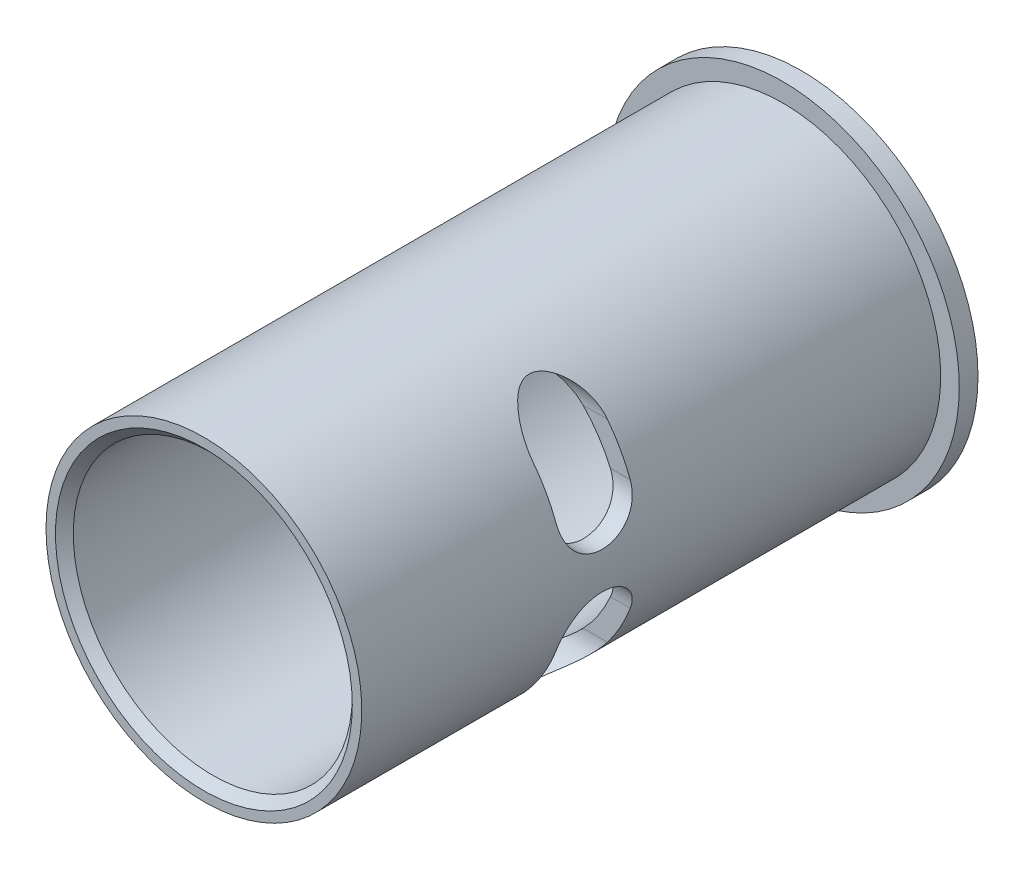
ISO-10303-21;
HEADER;
FILE_DESCRIPTION(('STEP AP214'),'2;1');
FILE_NAME('part.step','',(''),(''),'','','');
FILE_SCHEMA(('AUTOMOTIVE_DESIGN { 1 0 10303 214 1 1 1 1 }'));
ENDSEC;
DATA;
#1=APPLICATION_CONTEXT('core data for automotive mechanical design processes');
#2=APPLICATION_PROTOCOL_DEFINITION('international standard','automotive_design',2000,#1);
#3=PRODUCT_CONTEXT('',#1,'mechanical');
#4=PRODUCT('Part','Part','',(#3));
#5=PRODUCT_RELATED_PRODUCT_CATEGORY('part','',(#4));
#6=PRODUCT_DEFINITION_FORMATION('','',#4);
#7=PRODUCT_DEFINITION_CONTEXT('part definition',#1,'design');
#8=PRODUCT_DEFINITION('design','',#6,#7);
#9=PRODUCT_DEFINITION_SHAPE('','',#8);
#10=(LENGTH_UNIT() NAMED_UNIT(*) SI_UNIT(.MILLI.,.METRE.));
#11=(NAMED_UNIT(*) PLANE_ANGLE_UNIT() SI_UNIT($,.RADIAN.));
#12=(NAMED_UNIT(*) SI_UNIT($,.STERADIAN.) SOLID_ANGLE_UNIT());
#13=UNCERTAINTY_MEASURE_WITH_UNIT(LENGTH_MEASURE(1.E-05),#10,'distance_accuracy_value','');
#14=(GEOMETRIC_REPRESENTATION_CONTEXT(3) GLOBAL_UNCERTAINTY_ASSIGNED_CONTEXT((#13)) GLOBAL_UNIT_ASSIGNED_CONTEXT((#10,
#11,#12)) REPRESENTATION_CONTEXT('',''));
#15=CARTESIAN_POINT('',(0.,0.,0.));
#16=DIRECTION('',(0.,0.,1.));
#17=DIRECTION('',(1.,0.,0.));
#18=AXIS2_PLACEMENT_3D('',#15,#16,#17);
#19=CARTESIAN_POINT('',(0.,0.,0.));
#20=DIRECTION('',(0.,0.,1.));
#21=DIRECTION('',(1.,0.,0.));
#22=AXIS2_PLACEMENT_3D('',#19,#20,#21);
#23=PLANE('',#22);
#24=CARTESIAN_POINT('',(0.,0.,0.));
#25=DIRECTION('',(0.,0.,1.));
#26=DIRECTION('',(1.,0.,0.));
#27=AXIS2_PLACEMENT_3D('',#24,#25,#26);
#28=CIRCLE('',#27,15.8877);
#29=CARTESIAN_POINT('',(15.8877,0.,0.));
#30=VERTEX_POINT('',#29);
#31=EDGE_CURVE('E255',#30,#30,#28,.T.);
#32=ORIENTED_EDGE('',*,*,#31,.T.);
#33=EDGE_LOOP('',(#32));
#34=FACE_BOUND('',#33,.T.);
#35=CARTESIAN_POINT('',(0.,0.,0.));
#36=DIRECTION('',(0.,0.,1.));
#37=DIRECTION('',(1.,0.,0.));
#38=AXIS2_PLACEMENT_3D('',#35,#36,#37);
#39=CIRCLE('',#38,20.099782);
#40=CARTESIAN_POINT('',(20.099782,0.,0.));
#41=VERTEX_POINT('',#40);
#42=EDGE_CURVE('E20',#41,#41,#39,.T.);
#43=ORIENTED_EDGE('',*,*,#42,.F.);
#44=EDGE_LOOP('',(#43));
#45=FACE_BOUND('',#44,.T.);
#46=ADVANCED_FACE('F17',(#34,#45),#23,.F.);
#47=CARTESIAN_POINT('',(0.,0.,68.072));
#48=DIRECTION('',(0.,0.,1.));
#49=DIRECTION('',(1.,0.,0.));
#50=AXIS2_PLACEMENT_3D('',#47,#48,#49);
#51=CONICAL_SURFACE('',#50,16.9036999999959,0.785398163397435);
#52=CARTESIAN_POINT('',(0.,0.,67.0560000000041));
#53=DIRECTION('',(0.,0.,1.));
#54=DIRECTION('',(1.,0.,0.));
#55=AXIS2_PLACEMENT_3D('',#52,#53,#54);
#56=CIRCLE('',#55,15.8877);
#57=CARTESIAN_POINT('',(15.8877,0.,67.0560000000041));
#58=VERTEX_POINT('',#57);
#59=EDGE_CURVE('E261',#58,#58,#56,.F.);
#60=ORIENTED_EDGE('',*,*,#59,.T.);
#61=EDGE_LOOP('',(#60));
#62=FACE_BOUND('',#61,.T.);
#63=CARTESIAN_POINT('',(0.,0.,68.072));
#64=DIRECTION('',(0.,0.,1.));
#65=DIRECTION('',(1.,0.,0.));
#66=AXIS2_PLACEMENT_3D('',#63,#64,#65);
#67=CIRCLE('',#66,16.9036999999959);
#68=CARTESIAN_POINT('',(16.9036999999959,0.,68.072));
#69=VERTEX_POINT('',#68);
#70=EDGE_CURVE('E239',#69,#69,#67,.T.);
#71=ORIENTED_EDGE('',*,*,#70,.T.);
#72=EDGE_LOOP('',(#71));
#73=FACE_BOUND('',#72,.T.);
#74=ADVANCED_FACE('F363',(#62,#73),#51,.F.);
#75=CARTESIAN_POINT('',(0.,0.,0.));
#76=DIRECTION('',(0.,0.,1.));
#77=DIRECTION('',(1.,0.,0.));
#78=AXIS2_PLACEMENT_3D('',#75,#76,#77);
#79=CYLINDRICAL_SURFACE('',#78,20.099782);
#80=CARTESIAN_POINT('',(0.,0.,2.13359999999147));
#81=DIRECTION('',(0.,0.,1.));
#82=DIRECTION('',(1.,0.,0.));
#83=AXIS2_PLACEMENT_3D('',#80,#81,#82);
#84=CIRCLE('',#83,20.099782);
#85=CARTESIAN_POINT('',(20.099782,0.,2.13359999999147));
#86=VERTEX_POINT('',#85);
#87=EDGE_CURVE('E236',#86,#86,#84,.T.);
#88=ORIENTED_EDGE('',*,*,#87,.F.);
#89=EDGE_LOOP('',(#88));
#90=FACE_BOUND('',#89,.T.);
#91=ORIENTED_EDGE('',*,*,#42,.T.);
#92=EDGE_LOOP('',(#91));
#93=FACE_BOUND('',#92,.T.);
#94=ADVANCED_FACE('F360',(#90,#93),#79,.T.);
#95=CARTESIAN_POINT('',(0.,-6.33306666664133,40.5722666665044));
#96=DIRECTION('',(-1.,0.,0.));
#97=DIRECTION('',(0.,0.,1.));
#98=AXIS2_PLACEMENT_3D('',#95,#96,#97);
#99=CYLINDRICAL_SURFACE('',#98,4.2333333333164);
#100=CARTESIAN_POINT('',(14.5709051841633,-6.33306666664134,44.8055999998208));
#101=CARTESIAN_POINT('',(14.62095184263,-6.21795485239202,44.8056112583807));
#102=CARTESIAN_POINT('',(14.669618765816,-6.10221920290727,44.8009047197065));
#103=CARTESIAN_POINT('',(14.7639588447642,-5.87027235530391,44.7818337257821));
#104=CARTESIAN_POINT('',(14.8096307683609,-5.7540609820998,44.7674653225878));
#105=CARTESIAN_POINT('',(14.8977789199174,-5.52183609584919,44.7288155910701));
#106=CARTESIAN_POINT('',(14.9402496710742,-5.40582323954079,44.7045177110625));
#107=CARTESIAN_POINT('',(15.0217167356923,-5.17513201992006,44.6458962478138));
#108=CARTESIAN_POINT('',(15.0607135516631,-5.06045346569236,44.6115741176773));
#109=CARTESIAN_POINT('',(15.1352220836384,-4.83305533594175,44.5327715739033));
#110=CARTESIAN_POINT('',(15.1707231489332,-4.72034255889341,44.488261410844));
#111=CARTESIAN_POINT('',(15.2380500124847,-4.49825603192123,44.3892499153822));
#112=CARTESIAN_POINT('',(15.2698759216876,-4.38888218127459,44.3347488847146));
#113=CARTESIAN_POINT('',(15.3298312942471,-4.17464299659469,44.2160689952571));
#114=CARTESIAN_POINT('',(15.3579653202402,-4.06977220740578,44.1519022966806));
#115=CARTESIAN_POINT('',(15.4106680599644,-3.86541809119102,44.0142136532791));
#116=CARTESIAN_POINT('',(15.4352369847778,-3.76593444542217,43.9406922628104));
#117=CARTESIAN_POINT('',(15.4797564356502,-3.57840035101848,43.788895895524));
#118=CARTESIAN_POINT('',(15.4998819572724,-3.49002374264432,43.711074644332));
#119=CARTESIAN_POINT('',(15.5372465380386,-3.31972661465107,43.547967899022));
#120=CARTESIAN_POINT('',(15.5544846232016,-3.23780827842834,43.4626799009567));
#121=CARTESIAN_POINT('',(15.5862675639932,-3.08117885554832,43.2852612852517));
#122=CARTESIAN_POINT('',(15.60081244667,-3.00646769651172,43.1931307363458));
#123=CARTESIAN_POINT('',(15.6274356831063,-2.86486638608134,43.0026546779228));
#124=CARTESIAN_POINT('',(15.6395131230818,-2.7979791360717,42.9043068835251));
#125=CARTESIAN_POINT('',(15.6611986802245,-2.67390238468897,42.7042147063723));
#126=CARTESIAN_POINT('',(15.6708521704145,-2.61654279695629,42.6025806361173));
#127=CARTESIAN_POINT('',(15.6882162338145,-2.51033480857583,42.3947526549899));
#128=CARTESIAN_POINT('',(15.6959261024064,-2.46148949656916,42.2885571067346));
#129=CARTESIAN_POINT('',(15.7095875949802,-2.3727379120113,42.0724485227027));
#130=CARTESIAN_POINT('',(15.7155401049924,-2.33282713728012,41.9625373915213));
#131=CARTESIAN_POINT('',(15.7258614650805,-2.2622041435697,41.7396816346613));
#132=CARTESIAN_POINT('',(15.7302297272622,-2.23149534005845,41.6267358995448));
#133=CARTESIAN_POINT('',(15.7375281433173,-2.17942970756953,41.3982178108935));
#134=CARTESIAN_POINT('',(15.7404528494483,-2.15810833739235,41.2826372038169));
#135=CARTESIAN_POINT('',(15.744937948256,-2.12513943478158,41.0500350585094));
#136=CARTESIAN_POINT('',(15.7464978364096,-2.11349547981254,40.9330130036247));
#137=CARTESIAN_POINT('',(15.7483055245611,-2.09998366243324,40.698430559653));
#138=CARTESIAN_POINT('',(15.7485537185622,-2.09811286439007,40.5808703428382));
#139=CARTESIAN_POINT('',(15.7477477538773,-2.10415303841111,40.3459646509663));
#140=CARTESIAN_POINT('',(15.7466931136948,-2.11206762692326,40.2286192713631));
#141=CARTESIAN_POINT('',(15.7432375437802,-2.13767499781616,39.9946041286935));
#142=CARTESIAN_POINT('',(15.7408320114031,-2.15540120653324,39.8779380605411));
#143=CARTESIAN_POINT('',(15.7345882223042,-2.20051043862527,39.6465150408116));
#144=CARTESIAN_POINT('',(15.730749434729,-2.22789703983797,39.5317588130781));
#145=CARTESIAN_POINT('',(15.7169059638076,-2.32426629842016,39.1916891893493));
#146=CARTESIAN_POINT('',(15.7045708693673,-2.40748723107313,38.9703140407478));
#147=CARTESIAN_POINT('',(15.6723332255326,-2.60907881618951,38.5453675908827));
#148=CARTESIAN_POINT('',(15.6524428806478,-2.72739271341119,38.3417682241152));
#149=CARTESIAN_POINT('',(15.6033597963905,-2.99544262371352,37.9576585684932));
#150=CARTESIAN_POINT('',(15.5741677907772,-3.14517615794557,37.7771464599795));
#151=CARTESIAN_POINT('',(15.5049855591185,-3.47012987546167,37.4452305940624));
#152=CARTESIAN_POINT('',(15.4650572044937,-3.64520145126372,37.2936683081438));
#153=CARTESIAN_POINT('',(15.3730573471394,-4.01552541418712,37.0222231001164));
#154=CARTESIAN_POINT('',(15.3209860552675,-4.21077745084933,36.9023396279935));
#155=CARTESIAN_POINT('',(15.203850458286,-4.61590947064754,36.6961286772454));
#156=CARTESIAN_POINT('',(15.1387211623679,-4.82585905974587,36.6099756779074));
#157=CARTESIAN_POINT('',(14.9959069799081,-5.25284283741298,36.472942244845));
#158=CARTESIAN_POINT('',(14.9182249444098,-5.46987540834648,36.4220538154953));
#159=CARTESIAN_POINT('',(14.793516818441,-5.79520090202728,36.3718137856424));
#160=CARTESIAN_POINT('',(14.7507212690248,-5.90328737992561,36.3594144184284));
#161=CARTESIAN_POINT('',(14.662647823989,-6.11876584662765,36.3429861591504));
#162=CARTESIAN_POINT('',(14.6173765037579,-6.22615890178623,36.3389361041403));
#163=CARTESIAN_POINT('',(14.5709051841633,-6.33306666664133,36.3389333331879));
#164=B_SPLINE_CURVE_WITH_KNOTS('',3,(#100,#101,#102,#103,#104,#105,#106,#107,#108,#109,#110,
#111,#112,#113,#114,#115,#116,#117,#118,#119,#120,#121,#122,#123,#124,#125,#126,#127,#128,#129,
#130,#131,#132,#133,#134,#135,#136,#137,#138,#139,#140,#141,#142,#143,#144,#145,#146,#147,#148,
#149,#150,#151,#152,#153,#154,#155,#156,#157,#158,#159,#160,#161,#162,#163),.UNSPECIFIED.,.F.,
.F.,(4,2,2,2,2,2,2,2,2,2,2,2,2,2,2,2,2,2,2,2,2,2,2,2,2,2,2,2,2,2,2,4),(0.,0.376496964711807,
0.753147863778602,1.13042918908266,1.50765585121,1.88599840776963,2.26432953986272,
2.64218861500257,3.02002530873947,3.37797959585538,3.73605438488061,4.0941255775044,
4.45232913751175,4.80322081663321,5.15423952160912,5.50508094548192,5.85605242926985,
6.20833848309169,6.5607547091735,6.91306507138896,7.26550567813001,7.61915444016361,
7.97293431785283,8.67971675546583,9.38536230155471,10.0909521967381,10.7925599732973,
11.4941555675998,12.1993338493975,12.904352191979,13.2548023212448,13.604363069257),.UNSPECIFIED.);
#165=CARTESIAN_POINT('',(14.5709051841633,-6.33306666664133,44.8055999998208));
#166=VERTEX_POINT('',#165);
#167=CARTESIAN_POINT('',(14.5709051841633,-6.33306666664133,36.338933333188));
#168=VERTEX_POINT('',#167);
#169=EDGE_CURVE('E112',#166,#168,#164,.T.);
#170=ORIENTED_EDGE('',*,*,#169,.T.);
#171=DIRECTION('',(-1.,0.,0.));
#172=VECTOR('',#171,1.);
#173=CARTESIAN_POINT('',(0.,-6.33306666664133,36.338933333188));
#174=LINE('',#173,#172);
#175=CARTESIAN_POINT('',(16.8311541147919,-6.33306666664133,36.338933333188));
#176=VERTEX_POINT('',#175);
#177=EDGE_CURVE('E260',#168,#176,#174,.F.);
#178=ORIENTED_EDGE('',*,*,#177,.T.);
#179=CARTESIAN_POINT('',(16.8311541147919,-6.33306666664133,44.8055999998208));
#180=CARTESIAN_POINT('',(16.8748363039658,-6.21700800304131,44.8056116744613));
#181=CARTESIAN_POINT('',(16.9173020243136,-6.10047345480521,44.8008273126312));
#182=CARTESIAN_POINT('',(16.9995926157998,-5.86724089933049,44.781517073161));
#183=CARTESIAN_POINT('',(17.0394166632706,-5.75054285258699,44.7669881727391));
#184=CARTESIAN_POINT('',(17.1162317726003,-5.51771384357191,44.7280173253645));
#185=CARTESIAN_POINT('',(17.1532195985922,-5.40158366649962,44.7035642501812));
#186=CARTESIAN_POINT('',(17.2241521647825,-5.17093919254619,44.6447023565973));
#187=CARTESIAN_POINT('',(17.2580972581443,-5.05642470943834,44.6102946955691));
#188=CARTESIAN_POINT('',(17.3229191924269,-4.82968829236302,44.5314838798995));
#189=CARTESIAN_POINT('',(17.3537891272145,-4.71747194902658,44.4870589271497));
#190=CARTESIAN_POINT('',(17.4123477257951,-4.49652052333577,44.3883972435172));
#191=CARTESIAN_POINT('',(17.4400351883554,-4.38778676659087,44.3341568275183));
#192=CARTESIAN_POINT('',(17.4922019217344,-4.17496626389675,44.2162332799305));
#193=CARTESIAN_POINT('',(17.5166856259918,-4.07087323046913,44.1525634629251));
#194=CARTESIAN_POINT('',(17.5625806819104,-3.86808162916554,44.0160874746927));
#195=CARTESIAN_POINT('',(17.5839909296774,-3.7693850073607,43.9432780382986));
#196=CARTESIAN_POINT('',(17.6230445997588,-3.58225384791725,43.7922050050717));
#197=CARTESIAN_POINT('',(17.6408064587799,-3.49356448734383,43.7142873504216));
#198=CARTESIAN_POINT('',(17.6737798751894,-3.3227337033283,43.5510198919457));
#199=CARTESIAN_POINT('',(17.6889905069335,-3.24059466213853,43.4656674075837));
#200=CARTESIAN_POINT('',(17.7170338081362,-3.08359470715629,43.2881609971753));
#201=CARTESIAN_POINT('',(17.7298666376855,-3.00873330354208,43.1960075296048));
#202=CARTESIAN_POINT('',(17.7533571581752,-2.86687373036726,43.0055206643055));
#203=CARTESIAN_POINT('',(17.764014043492,-2.79987847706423,42.9071849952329));
#204=CARTESIAN_POINT('',(17.7831933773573,-2.67533608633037,42.7067034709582));
#205=CARTESIAN_POINT('',(17.7917473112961,-2.61765467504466,42.6046439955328));
#206=CARTESIAN_POINT('',(17.8071284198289,-2.51089050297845,42.3959507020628));
#207=CARTESIAN_POINT('',(17.8139549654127,-2.46181087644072,42.2893152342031));
#208=CARTESIAN_POINT('',(17.826046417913,-2.3726725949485,42.0723138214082));
#209=CARTESIAN_POINT('',(17.831312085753,-2.33260954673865,41.9619497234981));
#210=CARTESIAN_POINT('',(17.8404370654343,-2.26176108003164,41.7381835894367));
#211=CARTESIAN_POINT('',(17.8442958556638,-2.2309791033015,41.6247804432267));
#212=CARTESIAN_POINT('',(17.8507341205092,-2.17886942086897,41.3954409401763));
#213=CARTESIAN_POINT('',(17.8533099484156,-2.15756868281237,41.279498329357));
#214=CARTESIAN_POINT('',(17.8572507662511,-2.12469501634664,41.0462100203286));
#215=CARTESIAN_POINT('',(17.8586153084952,-2.11312568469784,40.9288638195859));
#216=CARTESIAN_POINT('',(17.8609724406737,-2.09320247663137,40.5760367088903));
#217=CARTESIAN_POINT('',(17.8602347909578,-2.09958022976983,40.3395324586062));
#218=CARTESIAN_POINT('',(17.8540358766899,-2.15163128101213,39.8703693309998));
#219=CARTESIAN_POINT('',(17.8485607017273,-2.19742029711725,39.6377238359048));
#220=CARTESIAN_POINT('',(17.8321203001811,-2.32706113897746,39.1834608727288));
#221=CARTESIAN_POINT('',(17.8211551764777,-2.41091225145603,38.9618431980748));
#222=CARTESIAN_POINT('',(17.7924957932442,-2.6140050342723,38.5362861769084));
#223=CARTESIAN_POINT('',(17.7748100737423,-2.73320174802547,38.3323247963));
#224=CARTESIAN_POINT('',(17.7311703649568,-3.00328517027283,37.9475970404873));
#225=CARTESIAN_POINT('',(17.7052169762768,-3.15416957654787,37.7668289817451));
#226=CARTESIAN_POINT('',(17.6436573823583,-3.48201997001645,37.4342858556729));
#227=CARTESIAN_POINT('',(17.6080944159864,-3.65886754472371,37.2823859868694));
#228=CARTESIAN_POINT('',(17.5260977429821,-4.03336687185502,37.0105216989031));
#229=CARTESIAN_POINT('',(17.4796634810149,-4.23101968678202,36.8905589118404));
#230=CARTESIAN_POINT('',(17.3751662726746,-4.64156576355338,36.6847313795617));
#231=CARTESIAN_POINT('',(17.3170533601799,-4.85452189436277,36.5990180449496));
#232=CARTESIAN_POINT('',(17.1895458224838,-5.28828550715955,36.4636051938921));
#233=CARTESIAN_POINT('',(17.1201567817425,-5.50908906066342,36.413887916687));
#234=CARTESIAN_POINT('',(17.0119166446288,-5.83108324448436,36.3675676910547));
#235=CARTESIAN_POINT('',(16.9770663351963,-5.93178828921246,36.3567855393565));
#236=CARTESIAN_POINT('',(16.9054955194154,-6.13278510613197,36.3424786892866));
#237=CARTESIAN_POINT('',(16.8687795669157,-6.23307729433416,36.338937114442));
#238=CARTESIAN_POINT('',(16.8311541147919,-6.33306666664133,36.338933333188));
#239=B_SPLINE_CURVE_WITH_KNOTS('',3,(#179,#180,#181,#182,#183,#184,#185,#186,#187,#188,#189,
#190,#191,#192,#193,#194,#195,#196,#197,#198,#199,#200,#201,#202,#203,#204,#205,#206,#207,#208,
#209,#210,#211,#212,#213,#214,#215,#216,#217,#218,#219,#220,#221,#222,#223,#224,#225,#226,#227,
#228,#229,#230,#231,#232,#233,#234,#235,#236,#237,#238),.UNSPECIFIED.,.F.,.F.,(4,2,2,2,2,2,2,2,
2,2,2,2,2,2,2,2,2,2,2,2,2,2,2,2,2,2,2,2,2,4),(0.,0.371947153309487,0.744009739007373,
1.11649068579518,1.48892834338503,1.86218440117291,2.23558088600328,2.60845506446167,
2.98146283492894,3.3391796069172,3.69702588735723,4.05484806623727,4.41280248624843,
4.76501714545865,5.11735987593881,5.46953055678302,5.82183167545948,6.17512854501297,
6.52855593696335,7.23469721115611,7.9429189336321,8.6511273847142,9.35843889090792,
10.0656990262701,10.7698283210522,11.4739935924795,12.1812382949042,12.8881337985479,
13.2092438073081,13.5296045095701),.UNSPECIFIED.);
#240=CARTESIAN_POINT('',(16.8311541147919,-6.33306666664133,44.8055999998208));
#241=VERTEX_POINT('',#240);
#242=EDGE_CURVE('E115',#241,#176,#239,.T.);
#243=ORIENTED_EDGE('',*,*,#242,.F.);
#244=DIRECTION('',(1.,0.,0.));
#245=VECTOR('',#244,1.);
#246=CARTESIAN_POINT('',(0.,-6.33306666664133,44.8055999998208));
#247=LINE('',#246,#245);
#248=EDGE_CURVE('E109',#241,#166,#247,.F.);
#249=ORIENTED_EDGE('',*,*,#248,.T.);
#250=EDGE_LOOP('',(#170,#178,#243,#249));
#251=FACE_BOUND('',#250,.T.);
#252=ADVANCED_FACE('F110',(#251),#99,.F.);
#253=CARTESIAN_POINT('',(0.,-6.33306666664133,36.338933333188));
#254=DIRECTION('',(0.,0.,-1.));
#255=DIRECTION('',(-1.,0.,0.));
#256=AXIS2_PLACEMENT_3D('',#253,#254,#255);
#257=PLANE('',#256);
#258=CARTESIAN_POINT('',(0.,0.,36.338933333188));
#259=DIRECTION('',(0.,0.,1.));
#260=DIRECTION('',(1.,0.,0.));
#261=AXIS2_PLACEMENT_3D('',#258,#259,#260);
#262=CIRCLE('',#261,15.8877);
#263=CARTESIAN_POINT('',(11.4574124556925,-11.0066666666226,36.338933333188));
#264=VERTEX_POINT('',#263);
#265=EDGE_CURVE('E126',#168,#264,#262,.F.);
#266=ORIENTED_EDGE('',*,*,#265,.T.);
#267=DIRECTION('',(-1.,0.,0.));
#268=VECTOR('',#267,1.);
#269=CARTESIAN_POINT('',(0.,-11.0066666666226,36.338933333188));
#270=LINE('',#269,#268);
#271=CARTESIAN_POINT('',(14.2214194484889,-11.0066666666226,36.338933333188));
#272=VERTEX_POINT('',#271);
#273=EDGE_CURVE('E117',#264,#272,#270,.F.);
#274=ORIENTED_EDGE('',*,*,#273,.T.);
#275=CARTESIAN_POINT('',(0.,0.,36.338933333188));
#276=DIRECTION('',(0.,0.,-1.));
#277=DIRECTION('',(-1.,0.,0.));
#278=AXIS2_PLACEMENT_3D('',#275,#276,#277);
#279=CIRCLE('',#278,17.9832);
#280=EDGE_CURVE('E275',#176,#272,#279,.T.);
#281=ORIENTED_EDGE('',*,*,#280,.F.);
#282=ORIENTED_EDGE('',*,*,#177,.F.);
#283=EDGE_LOOP('',(#266,#274,#281,#282));
#284=FACE_BOUND('',#283,.T.);
#285=ADVANCED_FACE('F274',(#284),#257,.F.);
#286=CARTESIAN_POINT('',(0.,-11.0066666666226,40.5722666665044));
#287=DIRECTION('',(-1.,0.,0.));
#288=DIRECTION('',(0.,0.,1.));
#289=AXIS2_PLACEMENT_3D('',#286,#287,#288);
#290=CYLINDRICAL_SURFACE('',#289,4.2333333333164);
#291=CARTESIAN_POINT('',(11.4574124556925,-11.0066666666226,36.338933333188));
#292=CARTESIAN_POINT('',(11.3760341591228,-11.0913802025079,36.3389366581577));
#293=CARTESIAN_POINT('',(11.2937317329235,-11.1751695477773,36.3414757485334));
#294=CARTESIAN_POINT('',(11.1274546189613,-11.3407458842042,36.3513207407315));
#295=CARTESIAN_POINT('',(11.0434803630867,-11.4225333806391,36.3586254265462));
#296=CARTESIAN_POINT('',(10.7895430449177,-11.6644478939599,36.3872001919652));
#297=CARTESIAN_POINT('',(10.6172836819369,-11.8214200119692,36.4151331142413));
#298=CARTESIAN_POINT('',(10.2679308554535,-12.1261030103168,36.4866243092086));
#299=CARTESIAN_POINT('',(10.090836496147,-12.2738121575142,36.5301854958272));
#300=CARTESIAN_POINT('',(9.73278379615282,-12.5596355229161,36.6311530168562));
#301=CARTESIAN_POINT('',(9.55182353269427,-12.6977448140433,36.688566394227));
#302=CARTESIAN_POINT('',(9.12468830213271,-13.0096448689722,36.8375056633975));
#303=CARTESIAN_POINT('',(8.87735814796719,-13.179502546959,36.9339842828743));
#304=CARTESIAN_POINT('',(8.37959626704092,-13.5014563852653,37.1467175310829));
#305=CARTESIAN_POINT('',(8.12916319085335,-13.6535444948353,37.2629810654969));
#306=CARTESIAN_POINT('',(7.62776806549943,-13.9398453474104,37.513867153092));
#307=CARTESIAN_POINT('',(7.37680721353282,-14.0740823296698,37.6484642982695));
#308=CARTESIAN_POINT('',(7.00209937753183,-14.2621588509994,37.8645080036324));
#309=CARTESIAN_POINT('',(6.87752090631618,-14.3226225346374,37.9388573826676));
#310=CARTESIAN_POINT('',(6.6294302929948,-14.4391283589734,38.0926235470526));
#311=CARTESIAN_POINT('',(6.50591804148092,-14.4951709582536,38.1720398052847));
#312=CARTESIAN_POINT('',(6.2338634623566,-14.6145330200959,38.3544381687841));
#313=CARTESIAN_POINT('',(6.08574995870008,-14.6767661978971,38.4587774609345));
#314=CARTESIAN_POINT('',(5.793842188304,-14.7944288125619,38.6776710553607));
#315=CARTESIAN_POINT('',(5.65005615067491,-14.8498458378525,38.7922433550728));
#316=CARTESIAN_POINT('',(5.44008645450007,-14.9274966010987,38.9745817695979));
#317=CARTESIAN_POINT('',(5.37070916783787,-14.952581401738,39.037455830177));
#318=CARTESIAN_POINT('',(5.23503266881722,-15.0006201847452,39.1671903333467));
#319=CARTESIAN_POINT('',(5.168732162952,-15.0235750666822,39.2340490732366));
#320=CARTESIAN_POINT('',(5.04066963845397,-15.0670241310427,39.3723312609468));
#321=CARTESIAN_POINT('',(4.97889296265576,-15.0875264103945,39.4437384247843));
#322=CARTESIAN_POINT('',(4.86167118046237,-15.1257048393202,39.5922127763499));
#323=CARTESIAN_POINT('',(4.80621673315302,-15.143385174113,39.6692713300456));
#324=CARTESIAN_POINT('',(4.71259004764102,-15.172756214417,39.8175559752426));
#325=CARTESIAN_POINT('',(4.67307132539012,-15.1849510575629,39.8878157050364));
#326=CARTESIAN_POINT('',(4.60345688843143,-15.206200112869,40.033356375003));
#327=CARTESIAN_POINT('',(4.57335191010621,-15.2152574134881,40.1086322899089));
#328=CARTESIAN_POINT('',(4.52553153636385,-15.2295511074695,40.264751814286));
#329=CARTESIAN_POINT('',(4.50800282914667,-15.2347299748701,40.3456605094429));
#330=CARTESIAN_POINT('',(4.48906251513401,-15.240323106,40.5094881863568));
#331=CARTESIAN_POINT('',(4.4876256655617,-15.2407448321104,40.5924038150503));
#332=CARTESIAN_POINT('',(4.50007364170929,-15.2370719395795,40.7447333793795));
#333=CARTESIAN_POINT('',(4.51176333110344,-15.2336244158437,40.8143591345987));
#334=CARTESIAN_POINT('',(4.54548364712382,-15.2235967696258,40.950820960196));
#335=CARTESIAN_POINT('',(4.56752630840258,-15.2170130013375,41.0176536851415));
#336=CARTESIAN_POINT('',(4.63502917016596,-15.1966227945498,41.1855754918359));
#337=CARTESIAN_POINT('',(4.68664902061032,-15.1808434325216,41.2839066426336));
#338=CARTESIAN_POINT('',(4.802855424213,-15.1444818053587,41.4716001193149));
#339=CARTESIAN_POINT('',(4.8674869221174,-15.1238828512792,41.5609297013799));
#340=CARTESIAN_POINT('',(5.02814163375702,-15.0713677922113,41.7611216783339));
#341=CARTESIAN_POINT('',(5.12736782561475,-15.0379848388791,41.8689824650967));
#342=CARTESIAN_POINT('',(5.33406738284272,-14.9659218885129,42.0746902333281));
#343=CARTESIAN_POINT('',(5.44155720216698,-14.9272311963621,42.1725162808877));
#344=CARTESIAN_POINT('',(5.66211666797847,-14.8449785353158,42.3608637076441));
#345=CARTESIAN_POINT('',(5.77521558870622,-14.8013890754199,42.4513383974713));
#346=CARTESIAN_POINT('',(6.00444161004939,-14.709892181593,42.625779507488));
#347=CARTESIAN_POINT('',(6.12056628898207,-14.6619881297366,42.7097509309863));
#348=CARTESIAN_POINT('',(6.35761143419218,-14.5607963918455,42.8741813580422));
#349=CARTESIAN_POINT('',(6.47858013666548,-14.5074071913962,42.9545079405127));
#350=CARTESIAN_POINT('',(6.72181476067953,-14.3963230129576,43.1100737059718));
#351=CARTESIAN_POINT('',(6.84408089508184,-14.3386273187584,43.1853120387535));
#352=CARTESIAN_POINT('',(7.21213236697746,-14.1590477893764,43.4041041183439));
#353=CARTESIAN_POINT('',(7.45901771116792,-14.0307362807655,43.5406310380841));
#354=CARTESIAN_POINT('',(7.95124974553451,-13.7577451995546,43.7951953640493));
#355=CARTESIAN_POINT('',(8.19659791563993,-13.6131514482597,43.9133225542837));
#356=CARTESIAN_POINT('',(8.68483955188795,-13.3069732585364,44.131054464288));
#357=CARTESIAN_POINT('',(8.92773390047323,-13.1453951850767,44.2306660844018));
#358=CARTESIAN_POINT('',(9.36799307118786,-12.8343074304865,44.3940708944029));
#359=CARTESIAN_POINT('',(9.56604418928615,-12.6874550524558,44.4610761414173));
#360=CARTESIAN_POINT('',(9.95788602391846,-12.382291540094,44.5792017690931));
#361=CARTESIAN_POINT('',(10.1516789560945,-12.2239865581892,44.6303306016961));
#362=CARTESIAN_POINT('',(10.5349628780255,-11.8952774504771,44.7147820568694));
#363=CARTESIAN_POINT('',(10.724421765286,-11.7248074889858,44.7479979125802));
#364=CARTESIAN_POINT('',(11.003395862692,-11.4612705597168,44.7820541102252));
#365=CARTESIAN_POINT('',(11.0956088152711,-11.3720253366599,44.7907790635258));
#366=CARTESIAN_POINT('',(11.2780545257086,-11.1911134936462,44.8025505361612));
#367=CARTESIAN_POINT('',(11.3682866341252,-11.0994461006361,44.8055952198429));
#368=CARTESIAN_POINT('',(11.4574124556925,-11.0066666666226,44.8055999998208));
#369=B_SPLINE_CURVE_WITH_KNOTS('',3,(#291,#292,#293,#294,#295,#296,#297,#298,#299,#300,#301,
#302,#303,#304,#305,#306,#307,#308,#309,#310,#311,#312,#313,#314,#315,#316,#317,#318,#319,#320,
#321,#322,#323,#324,#325,#326,#327,#328,#329,#330,#331,#332,#333,#334,#335,#336,#337,#338,#339,
#340,#341,#342,#343,#344,#345,#346,#347,#348,#349,#350,#351,#352,#353,#354,#355,#356,#357,#358,
#359,#360,#361,#362,#363,#364,#365,#366,#367,#368),.UNSPECIFIED.,.F.,.F.,(4,2,2,2,2,2,2,2,2,2,2,
2,2,2,2,2,2,2,2,2,2,2,2,2,2,2,2,2,2,2,2,2,2,2,2,2,2,2,4),(0.,0.352325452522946,0.70456103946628,
1.40781704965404,2.1112042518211,2.81494983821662,3.75916478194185,4.70380586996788,
5.64715088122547,6.11855494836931,6.58991005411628,7.16427485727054,7.73967050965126,
8.03034866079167,8.32090348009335,8.61047092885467,8.89960484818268,9.1436191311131,
9.38739252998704,9.63471368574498,9.8816468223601,10.0927133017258,10.3040257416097,
10.6385994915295,10.9743493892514,11.4242222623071,11.875015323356,12.3284779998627,
12.781588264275,13.2455584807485,13.709606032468,14.638287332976,15.562284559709,
16.4859367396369,17.251723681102,18.0171022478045,18.7869936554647,19.1727204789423,
19.5585719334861),.UNSPECIFIED.);
#370=CARTESIAN_POINT('',(11.4574124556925,-11.0066666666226,44.8055999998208));
#371=VERTEX_POINT('',#370);
#372=EDGE_CURVE('E128',#264,#371,#369,.T.);
#373=ORIENTED_EDGE('',*,*,#372,.T.);
#374=DIRECTION('',(1.,0.,0.));
#375=VECTOR('',#374,1.);
#376=CARTESIAN_POINT('',(0.,-11.0066666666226,44.8055999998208));
#377=LINE('',#376,#375);
#378=CARTESIAN_POINT('',(14.2214194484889,-11.0066666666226,44.8055999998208));
#379=VERTEX_POINT('',#378);
#380=EDGE_CURVE('E104',#371,#379,#377,.T.);
#381=ORIENTED_EDGE('',*,*,#380,.T.);
#382=CARTESIAN_POINT('',(14.2214194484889,-11.0066666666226,36.338933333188));
#383=CARTESIAN_POINT('',(14.1115802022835,-11.1486191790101,36.3389501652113));
#384=CARTESIAN_POINT('',(13.9996301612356,-11.2888456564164,36.3460713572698));
#385=CARTESIAN_POINT('',(13.77234813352,-11.5650194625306,36.3736206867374));
#386=CARTESIAN_POINT('',(13.6570188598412,-11.7009700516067,36.3940384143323));
#387=CARTESIAN_POINT('',(13.4236982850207,-11.9679270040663,36.4472694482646));
#388=CARTESIAN_POINT('',(13.3057082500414,-12.0989356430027,36.4800769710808));
#389=CARTESIAN_POINT('',(13.0677093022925,-12.3556094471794,36.5573650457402));
#390=CARTESIAN_POINT('',(12.9476998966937,-12.4812732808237,36.6018484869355));
#391=CARTESIAN_POINT('',(12.6945547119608,-12.7388970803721,36.7068178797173));
#392=CARTESIAN_POINT('',(12.5612876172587,-12.8702627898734,36.7684466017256));
#393=CARTESIAN_POINT('',(12.2942227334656,-13.1256125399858,36.9045538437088));
#394=CARTESIAN_POINT('',(12.1604248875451,-13.2495957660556,36.979033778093));
#395=CARTESIAN_POINT('',(11.8933560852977,-13.4898423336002,37.140659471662));
#396=CARTESIAN_POINT('',(11.7600855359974,-13.6061005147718,37.2278135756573));
#397=CARTESIAN_POINT('',(11.4955456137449,-13.8303268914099,37.414835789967));
#398=CARTESIAN_POINT('',(11.3642756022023,-13.9382977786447,37.5146997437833));
#399=CARTESIAN_POINT('',(11.1465008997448,-14.1125418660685,37.6939104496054));
#400=CARTESIAN_POINT('',(11.0589867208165,-14.1811903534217,37.7697371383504));
#401=CARTESIAN_POINT('',(10.8864701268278,-14.3140522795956,37.9278432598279));
#402=CARTESIAN_POINT('',(10.8014671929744,-14.3782666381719,38.0101213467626));
#403=CARTESIAN_POINT('',(10.6350186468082,-14.5018130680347,38.181408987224));
#404=CARTESIAN_POINT('',(10.5535683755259,-14.5611516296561,38.2704092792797));
#405=CARTESIAN_POINT('',(10.3954017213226,-14.6744872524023,38.455668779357));
#406=CARTESIAN_POINT('',(10.3186835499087,-14.7284863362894,38.5519252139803));
#407=CARTESIAN_POINT('',(10.1464451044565,-14.8478782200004,38.7864953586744));
#408=CARTESIAN_POINT('',(10.0534472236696,-14.9108673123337,38.9279486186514));
#409=CARTESIAN_POINT('',(9.88464392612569,-15.0233012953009,39.22579663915));
#410=CARTESIAN_POINT('',(9.80881022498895,-15.0727684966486,39.3821662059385));
#411=CARTESIAN_POINT('',(9.69697178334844,-15.1448866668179,39.6706870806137));
#412=CARTESIAN_POINT('',(9.65579585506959,-15.171107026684,39.7999024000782));
#413=CARTESIAN_POINT('',(9.59191980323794,-15.2115750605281,40.0646129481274));
#414=CARTESIAN_POINT('',(9.56919435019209,-15.2258391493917,40.2000992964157));
#415=CARTESIAN_POINT('',(9.54485480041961,-15.2411110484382,40.4745334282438));
#416=CARTESIAN_POINT('',(9.54335807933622,-15.2420451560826,40.613496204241));
#417=CARTESIAN_POINT('',(9.56198150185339,-15.2303674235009,40.8893983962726));
#418=CARTESIAN_POINT('',(9.58211560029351,-15.2177468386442,41.0263364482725));
#419=CARTESIAN_POINT('',(9.64573649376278,-15.1775101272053,41.313261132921));
#420=CARTESIAN_POINT('',(9.69214779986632,-15.1480097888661,41.4623182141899));
#421=CARTESIAN_POINT('',(9.80421005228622,-15.0757219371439,41.7495329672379));
#422=CARTESIAN_POINT('',(9.86989854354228,-15.0329084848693,41.8876686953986));
#423=CARTESIAN_POINT('',(10.0541966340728,-14.9106114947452,42.2237482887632));
#424=CARTESIAN_POINT('',(10.1822494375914,-14.8237996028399,42.4138104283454));
#425=CARTESIAN_POINT('',(10.388273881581,-14.6794572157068,42.679853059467));
#426=CARTESIAN_POINT('',(10.4594031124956,-14.6288928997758,42.7654855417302));
#427=CARTESIAN_POINT('',(10.6052935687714,-14.5234737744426,42.9308218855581));
#428=CARTESIAN_POINT('',(10.6800538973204,-14.4686200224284,43.0105271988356));
#429=CARTESIAN_POINT('',(10.8789746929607,-14.3201554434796,43.211534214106));
#430=CARTESIAN_POINT('',(11.0053112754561,-14.2234080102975,43.3283657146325));
#431=CARTESIAN_POINT('',(11.2623354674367,-14.0207743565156,43.5486160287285));
#432=CARTESIAN_POINT('',(11.3930255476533,-13.9148828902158,43.6520270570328));
#433=CARTESIAN_POINT('',(11.6569911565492,-13.6945115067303,43.8461308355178));
#434=CARTESIAN_POINT('',(11.7902701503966,-13.5800193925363,43.9368049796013));
#435=CARTESIAN_POINT('',(12.0577357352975,-13.3431034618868,44.1054389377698));
#436=CARTESIAN_POINT('',(12.1919221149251,-13.2206814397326,44.1834016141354));
#437=CARTESIAN_POINT('',(12.4648008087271,-12.9638175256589,44.3290247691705));
#438=CARTESIAN_POINT('',(12.6034843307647,-12.8291034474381,44.3962223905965));
#439=CARTESIAN_POINT('',(12.8794670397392,-12.5520139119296,44.5163528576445));
#440=CARTESIAN_POINT('',(13.0167658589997,-12.4096364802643,44.5692820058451));
#441=CARTESIAN_POINT('',(13.2883833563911,-12.1183282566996,44.6598708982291));
#442=CARTESIAN_POINT('',(13.4227106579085,-11.9694216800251,44.697582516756));
#443=CARTESIAN_POINT('',(13.6877342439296,-11.6654192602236,44.7568941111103));
#444=CARTESIAN_POINT('',(13.818433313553,-11.5103284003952,44.7785067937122));
#445=CARTESIAN_POINT('',(13.9931946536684,-11.2956368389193,44.7961136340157));
#446=CARTESIAN_POINT('',(14.0393159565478,-11.2382613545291,44.7996547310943));
#447=CARTESIAN_POINT('',(14.1308817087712,-11.1229079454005,44.8043971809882));
#448=CARTESIAN_POINT('',(14.1763263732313,-11.0649302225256,44.8055992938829));
#449=CARTESIAN_POINT('',(14.2214194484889,-11.0066666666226,44.8055999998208));
#450=B_SPLINE_CURVE_WITH_KNOTS('',3,(#382,#383,#384,#385,#386,#387,#388,#389,#390,#391,#392,
#393,#394,#395,#396,#397,#398,#399,#400,#401,#402,#403,#404,#405,#406,#407,#408,#409,#410,#411,
#412,#413,#414,#415,#416,#417,#418,#419,#420,#421,#422,#423,#424,#425,#426,#427,#428,#429,#430,
#431,#432,#433,#434,#435,#436,#437,#438,#439,#440,#441,#442,#443,#444,#445,#446,#447,#448,#449),
.UNSPECIFIED.,.F.,.F.,(4,2,2,2,2,2,2,2,2,2,2,2,2,2,2,2,2,2,2,2,2,2,2,2,2,2,2,2,2,2,2,2,2,4),(0.,
0.538191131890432,1.07596142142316,1.61348099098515,2.15113370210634,2.74160525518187,
3.33214183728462,3.92306901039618,4.51380342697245,4.91742989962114,5.32097239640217,
5.72396871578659,6.12681177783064,6.66718095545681,7.20665308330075,7.61943941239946,
8.03165809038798,8.44615508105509,8.86091963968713,9.33492005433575,9.80984984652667,
10.5406973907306,10.9073450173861,11.2739025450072,11.8652773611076,12.4569937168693,
13.0495656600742,13.6420039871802,14.2554318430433,14.8690185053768,15.4804955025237,
16.0914893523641,16.312554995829,16.5335487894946),.UNSPECIFIED.);
#451=EDGE_CURVE('E218',#272,#379,#450,.T.);
#452=ORIENTED_EDGE('',*,*,#451,.F.);
#453=ORIENTED_EDGE('',*,*,#273,.F.);
#454=EDGE_LOOP('',(#373,#381,#452,#453));
#455=FACE_BOUND('',#454,.T.);
#456=ADVANCED_FACE('F268',(#455),#290,.F.);
#457=CARTESIAN_POINT('',(0.,-11.0066666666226,44.8055999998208));
#458=DIRECTION('',(0.,0.,1.));
#459=DIRECTION('',(1.,0.,0.));
#460=AXIS2_PLACEMENT_3D('',#457,#458,#459);
#461=PLANE('',#460);
#462=CARTESIAN_POINT('',(0.,0.,44.8055999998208));
#463=DIRECTION('',(0.,0.,1.));
#464=DIRECTION('',(1.,0.,0.));
#465=AXIS2_PLACEMENT_3D('',#462,#463,#464);
#466=CIRCLE('',#465,15.8877);
#467=EDGE_CURVE('E120',#371,#166,#466,.T.);
#468=ORIENTED_EDGE('',*,*,#467,.T.);
#469=ORIENTED_EDGE('',*,*,#248,.F.);
#470=CARTESIAN_POINT('',(0.,0.,44.8055999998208));
#471=DIRECTION('',(0.,0.,-1.));
#472=DIRECTION('',(-1.,0.,0.));
#473=AXIS2_PLACEMENT_3D('',#470,#471,#472);
#474=CIRCLE('',#473,17.9832);
#475=EDGE_CURVE('E277',#379,#241,#474,.F.);
#476=ORIENTED_EDGE('',*,*,#475,.F.);
#477=ORIENTED_EDGE('',*,*,#380,.F.);
#478=EDGE_LOOP('',(#468,#469,#476,#477));
#479=FACE_BOUND('',#478,.T.);
#480=ADVANCED_FACE('F121',(#479),#461,.F.);
#481=CARTESIAN_POINT('',(0.,-8.4666666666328,40.5722666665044));
#482=DIRECTION('',(1.,0.,0.));
#483=DIRECTION('',(0.,0.,-1.));
#484=AXIS2_PLACEMENT_3D('',#481,#482,#483);
#485=CYLINDRICAL_SURFACE('',#484,4.2333333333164);
#486=CARTESIAN_POINT('',(-13.4437556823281,-8.46666666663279,36.338933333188));
#487=CARTESIAN_POINT('',(-13.3475063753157,-8.61955258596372,36.3389442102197));
#488=CARTESIAN_POINT('',(-13.248649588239,-8.77068495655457,36.3472125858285));
#489=CARTESIAN_POINT('',(-13.0467514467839,-9.06825924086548,36.3792263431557));
#490=CARTESIAN_POINT('',(-12.9437140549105,-9.2147053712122,36.4029573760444));
#491=CARTESIAN_POINT('',(-12.7345337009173,-9.50169484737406,36.4647941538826));
#492=CARTESIAN_POINT('',(-12.628398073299,-9.64225047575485,36.5028681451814));
#493=CARTESIAN_POINT('',(-12.4137191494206,-9.91710560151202,36.5925379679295));
#494=CARTESIAN_POINT('',(-12.3051753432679,-10.0514037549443,36.6441366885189));
#495=CARTESIAN_POINT('',(-12.091946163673,-10.3068027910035,36.7573523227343));
#496=CARTESIAN_POINT('',(-11.987327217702,-10.4282277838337,36.8183659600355));
#497=CARTESIAN_POINT('',(-11.7776981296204,-10.6644158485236,36.9515770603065));
#498=CARTESIAN_POINT('',(-11.6726879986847,-10.7791791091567,37.0237742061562));
#499=CARTESIAN_POINT('',(-11.4631683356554,-11.0017344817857,37.1791879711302));
#500=CARTESIAN_POINT('',(-11.3586593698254,-11.1095199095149,37.2624149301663));
#501=CARTESIAN_POINT('',(-11.1514212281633,-11.3175244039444,37.4397908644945));
#502=CARTESIAN_POINT('',(-11.0486916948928,-11.4177450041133,37.5339376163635));
#503=CARTESIAN_POINT('',(-10.8692883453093,-11.5883236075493,37.7108233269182));
#504=CARTESIAN_POINT('',(-10.7919712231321,-11.6603129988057,37.791334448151));
#505=CARTESIAN_POINT('',(-10.6401103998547,-11.7990544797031,37.959190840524));
#506=CARTESIAN_POINT('',(-10.5655674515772,-11.8658051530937,38.0465379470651));
#507=CARTESIAN_POINT('',(-10.347836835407,-12.0572908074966,38.3188809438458));
#508=CARTESIAN_POINT('',(-10.2100902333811,-12.1736887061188,38.514615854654));
#509=CARTESIAN_POINT('',(-10.0007337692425,-12.3457129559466,38.8694001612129));
#510=CARTESIAN_POINT('',(-9.92196762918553,-12.4089273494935,39.0205464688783));
#511=CARTESIAN_POINT('',(-9.78259914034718,-12.5190908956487,39.3366121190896));
#512=CARTESIAN_POINT('',(-9.72196771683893,-12.5660661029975,39.5015088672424));
#513=CARTESIAN_POINT('',(-9.6337469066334,-12.6337841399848,39.8127000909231));
#514=CARTESIAN_POINT('',(-9.6022233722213,-12.6576861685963,39.9571712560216));
#515=CARTESIAN_POINT('',(-9.55902375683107,-12.6903443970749,40.2507111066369));
#516=CARTESIAN_POINT('',(-9.54732873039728,-12.6991150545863,40.3997752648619));
#517=CARTESIAN_POINT('',(-9.54514334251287,-12.7007580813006,40.6984086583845));
#518=CARTESIAN_POINT('',(-9.55468921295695,-12.6936032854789,40.8479783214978));
#519=CARTESIAN_POINT('',(-9.59390391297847,-12.6639878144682,41.142915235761));
#520=CARTESIAN_POINT('',(-9.62359118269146,-12.6415131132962,41.2882785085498));
#521=CARTESIAN_POINT('',(-9.70996456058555,-12.5753425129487,41.6081414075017));
#522=CARTESIAN_POINT('',(-9.77165074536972,-12.5276589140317,41.7804408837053));
#523=CARTESIAN_POINT('',(-9.91491492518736,-12.4145778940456,42.1103462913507));
#524=CARTESIAN_POINT('',(-9.99653366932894,-12.3491441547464,42.2679211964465));
#525=CARTESIAN_POINT('',(-10.1509280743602,-12.2223158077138,42.529728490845));
#526=CARTESIAN_POINT('',(-10.2206970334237,-12.1641052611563,42.6373542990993));
#527=CARTESIAN_POINT('',(-10.3659287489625,-12.0405819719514,42.8444427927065));
#528=CARTESIAN_POINT('',(-10.4413942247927,-11.9752658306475,42.9439015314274));
#529=CARTESIAN_POINT('',(-10.5965974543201,-11.8381537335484,43.1350879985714));
#530=CARTESIAN_POINT('',(-10.6763437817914,-11.7663445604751,43.2267991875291));
#531=CARTESIAN_POINT('',(-10.8387555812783,-11.6169089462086,43.4025289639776));
#532=CARTESIAN_POINT('',(-10.9214209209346,-11.5392827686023,43.4865478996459));
#533=CARTESIAN_POINT('',(-11.116155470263,-11.3522594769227,43.6734306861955));
#534=CARTESIAN_POINT('',(-11.2289800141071,-11.2407894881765,43.7734429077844));
#535=CARTESIAN_POINT('',(-11.4563341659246,-11.0089872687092,43.9604662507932));
#536=CARTESIAN_POINT('',(-11.5708642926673,-10.8886522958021,44.0474733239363));
#537=CARTESIAN_POINT('',(-11.800007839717,-10.639895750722,44.2082094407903));
#538=CARTESIAN_POINT('',(-11.9146208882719,-10.5114863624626,44.2819578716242));
#539=CARTESIAN_POINT('',(-12.1428560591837,-10.2469781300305,44.4159069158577));
#540=CARTESIAN_POINT('',(-12.2564783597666,-10.1108807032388,44.4761100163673));
#541=CARTESIAN_POINT('',(-12.4631276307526,-9.85453912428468,44.5735798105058));
#542=CARTESIAN_POINT('',(-12.5564723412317,-9.73536225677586,44.6129895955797));
#543=CARTESIAN_POINT('',(-12.7410578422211,-9.49250844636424,44.6813623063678));
#544=CARTESIAN_POINT('',(-12.8322992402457,-9.36883283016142,44.710328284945));
#545=CARTESIAN_POINT('',(-13.0121909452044,-9.11733421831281,44.7572544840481));
#546=CARTESIAN_POINT('',(-13.1008382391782,-8.98950673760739,44.77520235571));
#547=CARTESIAN_POINT('',(-13.2748971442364,-8.7304432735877,44.7993771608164));
#548=CARTESIAN_POINT('',(-13.3603061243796,-8.5992046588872,44.805594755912));
#549=CARTESIAN_POINT('',(-13.4437556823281,-8.46666666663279,44.8055999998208));
#550=B_SPLINE_CURVE_WITH_KNOTS('',3,(#486,#487,#488,#489,#490,#491,#492,#493,#494,#495,#496,
#497,#498,#499,#500,#501,#502,#503,#504,#505,#506,#507,#508,#509,#510,#511,#512,#513,#514,#515,
#516,#517,#518,#519,#520,#521,#522,#523,#524,#525,#526,#527,#528,#529,#530,#531,#532,#533,#534,
#535,#536,#537,#538,#539,#540,#541,#542,#543,#544,#545,#546,#547,#548,#549),.UNSPECIFIED.,.F.,
.F.,(4,2,2,2,2,2,2,2,2,2,2,2,2,2,2,2,2,2,2,2,2,2,2,2,2,2,2,2,2,2,2,4),(0.,0.54162881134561,
1.08275572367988,1.62269161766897,2.16274294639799,2.67674495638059,3.19073239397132,
3.70520512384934,4.21957328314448,4.61773786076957,5.01600971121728,5.81027790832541,
6.35401061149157,6.89686683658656,7.344325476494,7.79135634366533,8.23915032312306,
8.68735482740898,9.25159915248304,9.817006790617,10.2390241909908,10.6612443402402,
11.0843441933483,11.5074248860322,12.0692021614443,12.631153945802,13.1922772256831,
13.7532973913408,14.222178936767,14.6909233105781,15.1601920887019,15.6298342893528),.UNSPECIFIED.);
#551=CARTESIAN_POINT('',(-13.4437556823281,-8.4666666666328,36.338933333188));
#552=VERTEX_POINT('',#551);
#553=CARTESIAN_POINT('',(-13.4437556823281,-8.4666666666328,44.8055999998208));
#554=VERTEX_POINT('',#553);
#555=EDGE_CURVE('E168',#552,#554,#550,.T.);
#556=ORIENTED_EDGE('',*,*,#555,.F.);
#557=DIRECTION('',(-1.,0.,0.));
#558=VECTOR('',#557,1.);
#559=CARTESIAN_POINT('',(0.,-8.4666666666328,36.338933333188));
#560=LINE('',#559,#558);
#561=CARTESIAN_POINT('',(-15.8654038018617,-8.4666666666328,36.338933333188));
#562=VERTEX_POINT('',#561);
#563=EDGE_CURVE('E282',#552,#562,#560,.T.);
#564=ORIENTED_EDGE('',*,*,#563,.T.);
#565=CARTESIAN_POINT('',(-15.8654038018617,-8.4666666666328,44.8055999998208));
#566=CARTESIAN_POINT('',(-15.7800968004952,-8.62659180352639,44.8055968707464));
#567=CARTESIAN_POINT('',(-15.6923543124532,-8.78512057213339,44.7965405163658));
#568=CARTESIAN_POINT('',(-15.5130692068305,-9.09792929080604,44.7612254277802));
#569=CARTESIAN_POINT('',(-15.4215292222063,-9.25221206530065,44.734978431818));
#570=CARTESIAN_POINT('',(-15.2356889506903,-9.55515092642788,44.666216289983));
#571=CARTESIAN_POINT('',(-15.1413913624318,-9.70381220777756,44.6237165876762));
#572=CARTESIAN_POINT('',(-14.9510220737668,-9.99462891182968,44.5232303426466));
#573=CARTESIAN_POINT('',(-14.8549502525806,-10.1367838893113,44.4652427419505));
#574=CARTESIAN_POINT('',(-14.6747844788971,-10.3955608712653,44.3429686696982));
#575=CARTESIAN_POINT('',(-14.5907647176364,-10.5130929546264,44.2804936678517));
#576=CARTESIAN_POINT('',(-14.42313576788,-10.7419183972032,44.1446676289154));
#577=CARTESIAN_POINT('',(-14.3395265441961,-10.853212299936,44.0713175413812));
#578=CARTESIAN_POINT('',(-14.0906363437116,-11.1768995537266,43.8352496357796));
#579=CARTESIAN_POINT('',(-13.9271178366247,-11.3793470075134,43.6563969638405));
#580=CARTESIAN_POINT('',(-13.6467700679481,-11.7131839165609,43.2977697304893));
#581=CARTESIAN_POINT('',(-13.5272397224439,-11.85063337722,43.1256944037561));
#582=CARTESIAN_POINT('',(-13.3040598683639,-12.1006357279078,42.7551900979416));
#583=CARTESIAN_POINT('',(-13.2003822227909,-12.2132328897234,42.5568090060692));
#584=CARTESIAN_POINT('',(-13.0386597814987,-12.3854556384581,42.1835104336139));
#585=CARTESIAN_POINT('',(-12.9756041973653,-12.4513084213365,42.0136978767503));
#586=CARTESIAN_POINT('',(-12.8955477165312,-12.5340255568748,41.7496504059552));
#587=CARTESIAN_POINT('',(-12.8712813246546,-12.5589229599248,41.6600684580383));
#588=CARTESIAN_POINT('',(-12.8281513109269,-12.6029746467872,41.4782488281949));
#589=CARTESIAN_POINT('',(-12.8092852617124,-12.6221315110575,41.3860123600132));
#590=CARTESIAN_POINT('',(-12.777323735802,-12.6544855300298,41.1986813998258));
#591=CARTESIAN_POINT('',(-12.7642783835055,-12.6676309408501,41.1035693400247));
#592=CARTESIAN_POINT('',(-12.7445900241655,-12.687438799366,40.9120554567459));
#593=CARTESIAN_POINT('',(-12.7379439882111,-12.6941043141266,40.8156542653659));
#594=CARTESIAN_POINT('',(-12.7312617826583,-12.700806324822,40.622398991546));
#595=CARTESIAN_POINT('',(-12.7312246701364,-12.7008437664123,40.5255449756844));
#596=CARTESIAN_POINT('',(-12.7377470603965,-12.6943015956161,40.3323149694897));
#597=CARTESIAN_POINT('',(-12.7443061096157,-12.6877224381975,40.2359389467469));
#598=CARTESIAN_POINT('',(-12.7713033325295,-12.660566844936,39.971435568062));
#599=CARTESIAN_POINT('',(-12.7985102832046,-12.6331432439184,39.8046201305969));
#600=CARTESIAN_POINT('',(-12.8704349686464,-12.5598553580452,39.4791675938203));
#601=CARTESIAN_POINT('',(-12.9151621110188,-12.5139811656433,39.3205349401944));
#602=CARTESIAN_POINT('',(-13.0373500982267,-12.3868162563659,38.9591623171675));
#603=CARTESIAN_POINT('',(-13.1207957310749,-12.2987307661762,38.7608346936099));
#604=CARTESIAN_POINT('',(-13.3059542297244,-12.0981709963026,38.3862505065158));
#605=CARTESIAN_POINT('',(-13.4077051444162,-11.9856458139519,38.2100412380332));
#606=CARTESIAN_POINT('',(-13.6567515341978,-11.7018960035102,37.8286853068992));
#607=CARTESIAN_POINT('',(-13.8083212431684,-11.5233307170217,37.6318014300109));
#608=CARTESIAN_POINT('',(-14.1211652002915,-11.1377750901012,37.2775841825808));
#609=CARTESIAN_POINT('',(-14.2824503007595,-10.9307526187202,37.1202960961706));
#610=CARTESIAN_POINT('',(-14.6095995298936,-10.48959759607,36.8443250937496));
#611=CARTESIAN_POINT('',(-14.7754960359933,-10.2551035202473,36.7262596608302));
#612=CARTESIAN_POINT('',(-15.1030211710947,-9.76628853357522,36.5348519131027));
#613=CARTESIAN_POINT('',(-15.2646582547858,-9.51201160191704,36.4614134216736));
#614=CARTESIAN_POINT('',(-15.4981172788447,-9.12283750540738,36.3880749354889));
#615=CARTESIAN_POINT('',(-15.5735954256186,-8.99339488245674,36.3697737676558));
#616=CARTESIAN_POINT('',(-15.7217311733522,-8.73185439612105,36.3452095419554));
#617=CARTESIAN_POINT('',(-15.7943898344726,-8.59975755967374,36.3389419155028));
#618=CARTESIAN_POINT('',(-15.8654038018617,-8.4666666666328,36.338933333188));
#619=B_SPLINE_CURVE_WITH_KNOTS('',3,(#565,#566,#567,#568,#569,#570,#571,#572,#573,#574,#575,
#576,#577,#578,#579,#580,#581,#582,#583,#584,#585,#586,#587,#588,#589,#590,#591,#592,#593,#594,
#595,#596,#597,#598,#599,#600,#601,#602,#603,#604,#605,#606,#607,#608,#609,#610,#611,#612,#613,
#614,#615,#616,#617,#618),.UNSPECIFIED.,.F.,.F.,(4,2,2,2,2,2,2,2,2,2,2,2,2,2,2,2,2,2,2,2,2,2,2,
2,2,2,4),(0.,0.543395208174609,1.08641975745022,1.62892959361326,2.17147649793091,
2.64317234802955,3.11482703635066,4.0571696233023,4.80640860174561,5.5543019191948,
6.13010042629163,6.41806905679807,6.70590804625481,6.99618003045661,7.2863145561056,
7.57640768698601,7.86648087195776,8.37769123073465,8.88917646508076,9.58282533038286,
10.2779330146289,11.1910968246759,12.1053002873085,13.0332804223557,13.95925348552,
14.4116555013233,14.8638857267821),.UNSPECIFIED.);
#620=CARTESIAN_POINT('',(-15.8654038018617,-8.4666666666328,44.8055999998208));
#621=VERTEX_POINT('',#620);
#622=EDGE_CURVE('E230',#621,#562,#619,.T.);
#623=ORIENTED_EDGE('',*,*,#622,.F.);
#624=DIRECTION('',(1.,0.,0.));
#625=VECTOR('',#624,1.);
#626=CARTESIAN_POINT('',(0.,-8.4666666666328,44.8055999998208));
#627=LINE('',#626,#625);
#628=EDGE_CURVE('E243',#621,#554,#627,.T.);
#629=ORIENTED_EDGE('',*,*,#628,.T.);
#630=EDGE_LOOP('',(#556,#564,#623,#629));
#631=FACE_BOUND('',#630,.T.);
#632=ADVANCED_FACE('F144',(#631),#485,.F.);
#633=CARTESIAN_POINT('',(0.,0.,-6.8072));
#634=DIRECTION('',(0.,0.,1.));
#635=DIRECTION('',(1.,0.,0.));
#636=AXIS2_PLACEMENT_3D('',#633,#634,#635);
#637=CYLINDRICAL_SURFACE('',#636,15.8877);
#638=ORIENTED_EDGE('',*,*,#59,.F.);
#639=EDGE_LOOP('',(#638));
#640=FACE_BOUND('',#639,.T.);
#641=ORIENTED_EDGE('',*,*,#31,.F.);
#642=EDGE_LOOP('',(#641));
#643=FACE_BOUND('',#642,.T.);
#644=CARTESIAN_POINT('',(0.,0.,36.338933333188));
#645=DIRECTION('',(0.,0.,1.));
#646=DIRECTION('',(1.,0.,0.));
#647=AXIS2_PLACEMENT_3D('',#644,#645,#646);
#648=CIRCLE('',#647,15.8877);
#649=CARTESIAN_POINT('',(14.5709051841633,6.33306666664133,36.338933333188));
#650=VERTEX_POINT('',#649);
#651=CARTESIAN_POINT('',(11.4574124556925,11.0066666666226,36.338933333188));
#652=VERTEX_POINT('',#651);
#653=EDGE_CURVE('E184',#650,#652,#648,.T.);
#654=ORIENTED_EDGE('',*,*,#653,.T.);
#655=CARTESIAN_POINT('',(11.4574124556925,11.0066666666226,36.338933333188));
#656=CARTESIAN_POINT('',(11.3760341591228,11.0913802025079,36.3389366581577));
#657=CARTESIAN_POINT('',(11.2937317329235,11.1751695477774,36.3414757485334));
#658=CARTESIAN_POINT('',(11.1274546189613,11.3407458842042,36.3513207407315));
#659=CARTESIAN_POINT('',(11.0434803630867,11.4225333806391,36.3586254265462));
#660=CARTESIAN_POINT('',(10.7895430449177,11.6644478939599,36.3872001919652));
#661=CARTESIAN_POINT('',(10.6172836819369,11.8214200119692,36.4151331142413));
#662=CARTESIAN_POINT('',(10.2679308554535,12.1261030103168,36.4866243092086));
#663=CARTESIAN_POINT('',(10.090836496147,12.2738121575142,36.5301854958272));
#664=CARTESIAN_POINT('',(9.73278379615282,12.5596355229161,36.6311530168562));
#665=CARTESIAN_POINT('',(9.55182353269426,12.6977448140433,36.688566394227));
#666=CARTESIAN_POINT('',(9.12468830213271,13.0096448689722,36.8375056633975));
#667=CARTESIAN_POINT('',(8.87735814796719,13.179502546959,36.9339842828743));
#668=CARTESIAN_POINT('',(8.37959626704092,13.5014563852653,37.1467175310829));
#669=CARTESIAN_POINT('',(8.12916319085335,13.6535444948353,37.2629810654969));
#670=CARTESIAN_POINT('',(7.62776806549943,13.9398453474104,37.513867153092));
#671=CARTESIAN_POINT('',(7.37680721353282,14.0740823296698,37.6484642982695));
#672=CARTESIAN_POINT('',(7.00209937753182,14.2621588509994,37.8645080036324));
#673=CARTESIAN_POINT('',(6.87752090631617,14.3226225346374,37.9388573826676));
#674=CARTESIAN_POINT('',(6.6294302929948,14.4391283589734,38.0926235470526));
#675=CARTESIAN_POINT('',(6.50591804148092,14.4951709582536,38.1720398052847));
#676=CARTESIAN_POINT('',(6.2338634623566,14.6145330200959,38.3544381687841));
#677=CARTESIAN_POINT('',(6.08574995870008,14.6767661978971,38.4587774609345));
#678=CARTESIAN_POINT('',(5.793842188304,14.7944288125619,38.6776710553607));
#679=CARTESIAN_POINT('',(5.65005615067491,14.8498458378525,38.7922433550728));
#680=CARTESIAN_POINT('',(5.44008645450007,14.9274966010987,38.9745817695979));
#681=CARTESIAN_POINT('',(5.37070916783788,14.952581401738,39.037455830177));
#682=CARTESIAN_POINT('',(5.23503266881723,15.0006201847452,39.1671903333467));
#683=CARTESIAN_POINT('',(5.16873216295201,15.0235750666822,39.2340490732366));
#684=CARTESIAN_POINT('',(5.04066963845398,15.0670241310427,39.3723312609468));
#685=CARTESIAN_POINT('',(4.97889296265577,15.0875264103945,39.4437384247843));
#686=CARTESIAN_POINT('',(4.86167118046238,15.1257048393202,39.5922127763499));
#687=CARTESIAN_POINT('',(4.80621673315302,15.143385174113,39.6692713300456));
#688=CARTESIAN_POINT('',(4.71259004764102,15.172756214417,39.8175559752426));
#689=CARTESIAN_POINT('',(4.67307132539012,15.1849510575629,39.8878157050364));
#690=CARTESIAN_POINT('',(4.60345688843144,15.206200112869,40.0333563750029));
#691=CARTESIAN_POINT('',(4.57335191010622,15.2152574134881,40.1086322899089));
#692=CARTESIAN_POINT('',(4.52553153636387,15.2295511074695,40.264751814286));
#693=CARTESIAN_POINT('',(4.50800282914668,15.2347299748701,40.3456605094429));
#694=CARTESIAN_POINT('',(4.48906251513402,15.240323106,40.5094881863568));
#695=CARTESIAN_POINT('',(4.48762566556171,15.2407448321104,40.5924038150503));
#696=CARTESIAN_POINT('',(4.5000736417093,15.2370719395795,40.7447333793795));
#697=CARTESIAN_POINT('',(4.51176333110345,15.2336244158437,40.8143591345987));
#698=CARTESIAN_POINT('',(4.54548364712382,15.2235967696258,40.950820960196));
#699=CARTESIAN_POINT('',(4.56752630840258,15.2170130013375,41.0176536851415));
#700=CARTESIAN_POINT('',(4.63502917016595,15.1966227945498,41.1855754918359));
#701=CARTESIAN_POINT('',(4.68664902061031,15.1808434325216,41.2839066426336));
#702=CARTESIAN_POINT('',(4.80285542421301,15.1444818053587,41.4716001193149));
#703=CARTESIAN_POINT('',(4.86748692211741,15.1238828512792,41.5609297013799));
#704=CARTESIAN_POINT('',(5.02814163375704,15.0713677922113,41.7611216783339));
#705=CARTESIAN_POINT('',(5.12736782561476,15.0379848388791,41.8689824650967));
#706=CARTESIAN_POINT('',(5.33406738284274,14.9659218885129,42.0746902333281));
#707=CARTESIAN_POINT('',(5.441557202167,14.9272311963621,42.1725162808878));
#708=CARTESIAN_POINT('',(5.66211666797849,14.8449785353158,42.3608637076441));
#709=CARTESIAN_POINT('',(5.77521558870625,14.8013890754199,42.4513383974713));
#710=CARTESIAN_POINT('',(6.00444161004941,14.709892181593,42.6257795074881));
#711=CARTESIAN_POINT('',(6.1205662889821,14.6619881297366,42.7097509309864));
#712=CARTESIAN_POINT('',(6.3576114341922,14.5607963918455,42.8741813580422));
#713=CARTESIAN_POINT('',(6.47858013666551,14.5074071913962,42.9545079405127));
#714=CARTESIAN_POINT('',(6.72181476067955,14.3963230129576,43.1100737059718));
#715=CARTESIAN_POINT('',(6.84408089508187,14.3386273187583,43.1853120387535));
#716=CARTESIAN_POINT('',(7.21213236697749,14.1590477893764,43.404104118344));
#717=CARTESIAN_POINT('',(7.45901771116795,14.0307362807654,43.5406310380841));
#718=CARTESIAN_POINT('',(7.95124974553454,13.7577451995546,43.7951953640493));
#719=CARTESIAN_POINT('',(8.19659791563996,13.6131514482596,43.9133225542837));
#720=CARTESIAN_POINT('',(8.68483955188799,13.3069732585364,44.1310544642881));
#721=CARTESIAN_POINT('',(8.92773390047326,13.1453951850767,44.2306660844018));
#722=CARTESIAN_POINT('',(9.36799307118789,12.8343074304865,44.3940708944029));
#723=CARTESIAN_POINT('',(9.56604418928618,12.6874550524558,44.4610761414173));
#724=CARTESIAN_POINT('',(9.95788602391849,12.382291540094,44.5792017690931));
#725=CARTESIAN_POINT('',(10.1516789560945,12.2239865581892,44.6303306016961));
#726=CARTESIAN_POINT('',(10.5349628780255,11.8952774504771,44.7147820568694));
#727=CARTESIAN_POINT('',(10.724421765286,11.7248074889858,44.7479979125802));
#728=CARTESIAN_POINT('',(11.003395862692,11.4612705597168,44.7820541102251));
#729=CARTESIAN_POINT('',(11.0956088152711,11.3720253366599,44.7907790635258));
#730=CARTESIAN_POINT('',(11.2780545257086,11.1911134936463,44.8025505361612));
#731=CARTESIAN_POINT('',(11.3682866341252,11.0994461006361,44.8055952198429));
#732=CARTESIAN_POINT('',(11.4574124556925,11.0066666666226,44.8055999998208));
#733=B_SPLINE_CURVE_WITH_KNOTS('',3,(#655,#656,#657,#658,#659,#660,#661,#662,#663,#664,#665,
#666,#667,#668,#669,#670,#671,#672,#673,#674,#675,#676,#677,#678,#679,#680,#681,#682,#683,#684,
#685,#686,#687,#688,#689,#690,#691,#692,#693,#694,#695,#696,#697,#698,#699,#700,#701,#702,#703,
#704,#705,#706,#707,#708,#709,#710,#711,#712,#713,#714,#715,#716,#717,#718,#719,#720,#721,#722,
#723,#724,#725,#726,#727,#728,#729,#730,#731,#732),.UNSPECIFIED.,.F.,.F.,(4,2,2,2,2,2,2,2,2,2,2,
2,2,2,2,2,2,2,2,2,2,2,2,2,2,2,2,2,2,2,2,2,2,2,2,2,2,2,4),(0.,0.352325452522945,0.70456103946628,
1.40781704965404,2.11120425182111,2.81494983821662,3.75916478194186,4.70380586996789,
5.64715088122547,6.11855494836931,6.58991005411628,7.16427485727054,7.73967050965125,
8.03034866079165,8.32090348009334,8.61047092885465,8.89960484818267,9.14361913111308,
9.38739252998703,9.63471368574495,9.88164682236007,10.0927133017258,10.3040257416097,
10.6385994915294,10.9743493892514,11.4242222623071,11.875015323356,12.3284779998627,
12.7815882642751,13.2455584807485,13.709606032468,14.638287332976,15.5622845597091,
16.4859367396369,17.251723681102,18.0171022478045,18.7869936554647,19.1727204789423,
19.5585719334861),.UNSPECIFIED.);
#734=CARTESIAN_POINT('',(11.4574124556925,11.0066666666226,44.8055999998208));
#735=VERTEX_POINT('',#734);
#736=EDGE_CURVE('E283',#652,#735,#733,.T.);
#737=ORIENTED_EDGE('',*,*,#736,.T.);
#738=CARTESIAN_POINT('',(0.,0.,44.8055999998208));
#739=DIRECTION('',(0.,0.,1.));
#740=DIRECTION('',(1.,0.,0.));
#741=AXIS2_PLACEMENT_3D('',#738,#739,#740);
#742=CIRCLE('',#741,15.8877);
#743=CARTESIAN_POINT('',(14.5709051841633,6.33306666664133,44.8055999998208));
#744=VERTEX_POINT('',#743);
#745=EDGE_CURVE('E182',#735,#744,#742,.F.);
#746=ORIENTED_EDGE('',*,*,#745,.T.);
#747=CARTESIAN_POINT('',(14.5709051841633,6.33306666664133,44.8055999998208));
#748=CARTESIAN_POINT('',(14.62095184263,6.21795485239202,44.8056112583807));
#749=CARTESIAN_POINT('',(14.669618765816,6.10221920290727,44.8009047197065));
#750=CARTESIAN_POINT('',(14.7639588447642,5.87027235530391,44.7818337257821));
#751=CARTESIAN_POINT('',(14.8096307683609,5.7540609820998,44.7674653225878));
#752=CARTESIAN_POINT('',(14.8977789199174,5.52183609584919,44.7288155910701));
#753=CARTESIAN_POINT('',(14.9402496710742,5.40582323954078,44.7045177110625));
#754=CARTESIAN_POINT('',(15.0217167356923,5.17513201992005,44.6458962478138));
#755=CARTESIAN_POINT('',(15.0607135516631,5.06045346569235,44.6115741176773));
#756=CARTESIAN_POINT('',(15.1352220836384,4.83305533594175,44.5327715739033));
#757=CARTESIAN_POINT('',(15.1707231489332,4.72034255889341,44.488261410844));
#758=CARTESIAN_POINT('',(15.2380500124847,4.49825603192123,44.3892499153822));
#759=CARTESIAN_POINT('',(15.2698759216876,4.38888218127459,44.3347488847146));
#760=CARTESIAN_POINT('',(15.3298312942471,4.17464299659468,44.2160689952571));
#761=CARTESIAN_POINT('',(15.3579653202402,4.06977220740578,44.1519022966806));
#762=CARTESIAN_POINT('',(15.4106680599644,3.86541809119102,44.0142136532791));
#763=CARTESIAN_POINT('',(15.4352369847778,3.76593444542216,43.9406922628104));
#764=CARTESIAN_POINT('',(15.4797564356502,3.57840035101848,43.788895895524));
#765=CARTESIAN_POINT('',(15.4998819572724,3.49002374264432,43.711074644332));
#766=CARTESIAN_POINT('',(15.5372465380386,3.31972661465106,43.5479678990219));
#767=CARTESIAN_POINT('',(15.5544846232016,3.23780827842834,43.4626799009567));
#768=CARTESIAN_POINT('',(15.5862675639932,3.08117885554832,43.2852612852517));
#769=CARTESIAN_POINT('',(15.60081244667,3.00646769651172,43.1931307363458));
#770=CARTESIAN_POINT('',(15.6274356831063,2.86486638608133,43.0026546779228));
#771=CARTESIAN_POINT('',(15.6395131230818,2.7979791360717,42.9043068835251));
#772=CARTESIAN_POINT('',(15.6611986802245,2.67390238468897,42.7042147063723));
#773=CARTESIAN_POINT('',(15.6708521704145,2.61654279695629,42.6025806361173));
#774=CARTESIAN_POINT('',(15.6882162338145,2.51033480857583,42.3947526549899));
#775=CARTESIAN_POINT('',(15.6959261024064,2.46148949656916,42.2885571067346));
#776=CARTESIAN_POINT('',(15.7095875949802,2.3727379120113,42.0724485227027));
#777=CARTESIAN_POINT('',(15.7155401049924,2.33282713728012,41.9625373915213));
#778=CARTESIAN_POINT('',(15.7258614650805,2.2622041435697,41.7396816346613));
#779=CARTESIAN_POINT('',(15.7302297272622,2.23149534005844,41.6267358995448));
#780=CARTESIAN_POINT('',(15.7375281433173,2.17942970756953,41.3982178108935));
#781=CARTESIAN_POINT('',(15.7404528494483,2.15810833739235,41.2826372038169));
#782=CARTESIAN_POINT('',(15.744937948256,2.12513943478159,41.0500350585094));
#783=CARTESIAN_POINT('',(15.7464978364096,2.11349547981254,40.9330130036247));
#784=CARTESIAN_POINT('',(15.7483055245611,2.09998366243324,40.698430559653));
#785=CARTESIAN_POINT('',(15.7485537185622,2.09811286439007,40.5808703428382));
#786=CARTESIAN_POINT('',(15.7477477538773,2.10415303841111,40.3459646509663));
#787=CARTESIAN_POINT('',(15.7466931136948,2.11206762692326,40.2286192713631));
#788=CARTESIAN_POINT('',(15.7432375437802,2.13767499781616,39.9946041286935));
#789=CARTESIAN_POINT('',(15.7408320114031,2.15540120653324,39.8779380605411));
#790=CARTESIAN_POINT('',(15.7345882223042,2.20051043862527,39.6465150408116));
#791=CARTESIAN_POINT('',(15.730749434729,2.22789703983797,39.5317588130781));
#792=CARTESIAN_POINT('',(15.7169059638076,2.32426629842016,39.1916891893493));
#793=CARTESIAN_POINT('',(15.7045708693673,2.40748723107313,38.9703140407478));
#794=CARTESIAN_POINT('',(15.6723332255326,2.60907881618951,38.5453675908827));
#795=CARTESIAN_POINT('',(15.6524428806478,2.7273927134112,38.3417682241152));
#796=CARTESIAN_POINT('',(15.6033597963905,2.99544262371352,37.9576585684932));
#797=CARTESIAN_POINT('',(15.5741677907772,3.14517615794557,37.7771464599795));
#798=CARTESIAN_POINT('',(15.5049855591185,3.47012987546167,37.4452305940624));
#799=CARTESIAN_POINT('',(15.4650572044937,3.64520145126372,37.2936683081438));
#800=CARTESIAN_POINT('',(15.3730573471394,4.01552541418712,37.0222231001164));
#801=CARTESIAN_POINT('',(15.3209860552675,4.21077745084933,36.9023396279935));
#802=CARTESIAN_POINT('',(15.203850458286,4.61590947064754,36.6961286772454));
#803=CARTESIAN_POINT('',(15.1387211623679,4.82585905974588,36.6099756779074));
#804=CARTESIAN_POINT('',(14.9959069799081,5.25284283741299,36.472942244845));
#805=CARTESIAN_POINT('',(14.9182249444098,5.46987540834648,36.4220538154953));
#806=CARTESIAN_POINT('',(14.793516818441,5.79520090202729,36.3718137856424));
#807=CARTESIAN_POINT('',(14.7507212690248,5.90328737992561,36.3594144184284));
#808=CARTESIAN_POINT('',(14.662647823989,6.11876584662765,36.3429861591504));
#809=CARTESIAN_POINT('',(14.6173765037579,6.22615890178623,36.3389361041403));
#810=CARTESIAN_POINT('',(14.5709051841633,6.33306666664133,36.3389333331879));
#811=B_SPLINE_CURVE_WITH_KNOTS('',3,(#747,#748,#749,#750,#751,#752,#753,#754,#755,#756,#757,
#758,#759,#760,#761,#762,#763,#764,#765,#766,#767,#768,#769,#770,#771,#772,#773,#774,#775,#776,
#777,#778,#779,#780,#781,#782,#783,#784,#785,#786,#787,#788,#789,#790,#791,#792,#793,#794,#795,
#796,#797,#798,#799,#800,#801,#802,#803,#804,#805,#806,#807,#808,#809,#810),.UNSPECIFIED.,.F.,
.F.,(4,2,2,2,2,2,2,2,2,2,2,2,2,2,2,2,2,2,2,2,2,2,2,2,2,2,2,2,2,2,2,4),(0.,0.376496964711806,
0.753147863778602,1.13042918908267,1.50765585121,1.88599840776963,2.26432953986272,
2.64218861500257,3.02002530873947,3.37797959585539,3.73605438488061,4.0941255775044,
4.45232913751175,4.80322081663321,5.15423952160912,5.50508094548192,5.85605242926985,
6.20833848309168,6.5607547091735,6.91306507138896,7.26550567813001,7.61915444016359,
7.97293431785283,8.67971675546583,9.38536230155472,10.0909521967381,10.7925599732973,
11.4941555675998,12.1993338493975,12.904352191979,13.2548023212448,13.604363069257),.UNSPECIFIED.);
#812=EDGE_CURVE('E173',#744,#650,#811,.T.);
#813=ORIENTED_EDGE('',*,*,#812,.T.);
#814=EDGE_LOOP('',(#654,#737,#746,#813));
#815=FACE_BOUND('',#814,.T.);
#816=ORIENTED_EDGE('',*,*,#555,.T.);
#817=CARTESIAN_POINT('',(0.,0.,44.8055999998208));
#818=DIRECTION('',(0.,0.,1.));
#819=DIRECTION('',(1.,0.,0.));
#820=AXIS2_PLACEMENT_3D('',#817,#818,#819);
#821=CIRCLE('',#820,15.8877);
#822=CARTESIAN_POINT('',(-13.4437556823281,8.4666666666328,44.8055999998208));
#823=VERTEX_POINT('',#822);
#824=EDGE_CURVE('E242',#554,#823,#821,.F.);
#825=ORIENTED_EDGE('',*,*,#824,.T.);
#826=CARTESIAN_POINT('',(-13.4437556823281,8.4666666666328,44.8055999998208));
#827=CARTESIAN_POINT('',(-13.3475063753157,8.61955258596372,44.8055891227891));
#828=CARTESIAN_POINT('',(-13.248649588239,8.77068495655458,44.7973207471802));
#829=CARTESIAN_POINT('',(-13.0467514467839,9.06825924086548,44.765306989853));
#830=CARTESIAN_POINT('',(-12.9437140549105,9.2147053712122,44.7415759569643));
#831=CARTESIAN_POINT('',(-12.7345337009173,9.50169484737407,44.6797391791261));
#832=CARTESIAN_POINT('',(-12.628398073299,9.64225047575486,44.6416651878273));
#833=CARTESIAN_POINT('',(-12.4137191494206,9.91710560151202,44.5519953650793));
#834=CARTESIAN_POINT('',(-12.3051753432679,10.0514037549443,44.5003966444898));
#835=CARTESIAN_POINT('',(-12.091946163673,10.3068027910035,44.3871810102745));
#836=CARTESIAN_POINT('',(-11.987327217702,10.4282277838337,44.3261673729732));
#837=CARTESIAN_POINT('',(-11.7776981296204,10.6644158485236,44.1929562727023));
#838=CARTESIAN_POINT('',(-11.6726879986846,10.7791791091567,44.1207591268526));
#839=CARTESIAN_POINT('',(-11.4631683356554,11.0017344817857,43.9653453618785));
#840=CARTESIAN_POINT('',(-11.3586593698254,11.1095199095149,43.8821184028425));
#841=CARTESIAN_POINT('',(-11.1514212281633,11.3175244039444,43.7047424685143));
#842=CARTESIAN_POINT('',(-11.0486916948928,11.4177450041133,43.6105957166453));
#843=CARTESIAN_POINT('',(-10.8692883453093,11.5883236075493,43.4337100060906));
#844=CARTESIAN_POINT('',(-10.7919712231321,11.6603129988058,43.3531988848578));
#845=CARTESIAN_POINT('',(-10.6401103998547,11.7990544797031,43.1853424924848));
#846=CARTESIAN_POINT('',(-10.5655674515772,11.8658051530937,43.0979953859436));
#847=CARTESIAN_POINT('',(-10.347836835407,12.0572908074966,42.825652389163));
#848=CARTESIAN_POINT('',(-10.2100902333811,12.1736887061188,42.6299174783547));
#849=CARTESIAN_POINT('',(-10.0007337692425,12.3457129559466,42.2751331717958));
#850=CARTESIAN_POINT('',(-9.92196762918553,12.4089273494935,42.1239868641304));
#851=CARTESIAN_POINT('',(-9.78259914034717,12.5190908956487,41.8079212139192));
#852=CARTESIAN_POINT('',(-9.72196771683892,12.5660661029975,41.6430244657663));
#853=CARTESIAN_POINT('',(-9.63374690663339,12.6337841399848,41.3318332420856));
#854=CARTESIAN_POINT('',(-9.60222337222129,12.6576861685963,41.1873620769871));
#855=CARTESIAN_POINT('',(-9.55902375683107,12.6903443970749,40.8938222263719));
#856=CARTESIAN_POINT('',(-9.54732873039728,12.6991150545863,40.7447580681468));
#857=CARTESIAN_POINT('',(-9.54514334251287,12.7007580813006,40.4461246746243));
#858=CARTESIAN_POINT('',(-9.55468921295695,12.6936032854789,40.2965550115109));
#859=CARTESIAN_POINT('',(-9.59390391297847,12.6639878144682,40.0016180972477));
#860=CARTESIAN_POINT('',(-9.62359118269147,12.6415131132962,39.856254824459));
#861=CARTESIAN_POINT('',(-9.70996456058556,12.5753425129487,39.536391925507));
#862=CARTESIAN_POINT('',(-9.77165074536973,12.5276589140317,39.3640924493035));
#863=CARTESIAN_POINT('',(-9.91491492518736,12.4145778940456,39.034187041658));
#864=CARTESIAN_POINT('',(-9.99653366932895,12.3491441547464,38.8766121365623));
#865=CARTESIAN_POINT('',(-10.1509280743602,12.2223158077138,38.6148048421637));
#866=CARTESIAN_POINT('',(-10.2206970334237,12.1641052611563,38.5071790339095));
#867=CARTESIAN_POINT('',(-10.3659287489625,12.0405819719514,38.3000905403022));
#868=CARTESIAN_POINT('',(-10.4413942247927,11.9752658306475,38.2006318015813));
#869=CARTESIAN_POINT('',(-10.5965974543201,11.8381537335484,38.0094453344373));
#870=CARTESIAN_POINT('',(-10.6763437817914,11.7663445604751,37.9177341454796));
#871=CARTESIAN_POINT('',(-10.8387555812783,11.6169089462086,37.7420043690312));
#872=CARTESIAN_POINT('',(-10.9214209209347,11.5392827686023,37.6579854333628));
#873=CARTESIAN_POINT('',(-11.116155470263,11.3522594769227,37.4711026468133));
#874=CARTESIAN_POINT('',(-11.2289800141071,11.2407894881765,37.3710904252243));
#875=CARTESIAN_POINT('',(-11.4563341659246,11.0089872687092,37.1840670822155));
#876=CARTESIAN_POINT('',(-11.5708642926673,10.8886522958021,37.0970600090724));
#877=CARTESIAN_POINT('',(-11.800007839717,10.639895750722,36.9363238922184));
#878=CARTESIAN_POINT('',(-11.9146208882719,10.5114863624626,36.8625754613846));
#879=CARTESIAN_POINT('',(-12.1428560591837,10.2469781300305,36.728626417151));
#880=CARTESIAN_POINT('',(-12.2564783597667,10.1108807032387,36.6684233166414));
#881=CARTESIAN_POINT('',(-12.4631276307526,9.85453912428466,36.570953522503));
#882=CARTESIAN_POINT('',(-12.5564723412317,9.73536225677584,36.5315437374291));
#883=CARTESIAN_POINT('',(-12.7410578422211,9.49250844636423,36.4631710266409));
#884=CARTESIAN_POINT('',(-12.8322992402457,9.36883283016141,36.4342050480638));
#885=CARTESIAN_POINT('',(-13.0121909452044,9.1173342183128,36.3872788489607));
#886=CARTESIAN_POINT('',(-13.1008382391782,8.98950673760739,36.3693309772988));
#887=CARTESIAN_POINT('',(-13.2748971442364,8.7304432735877,36.3451561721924));
#888=CARTESIAN_POINT('',(-13.3603061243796,8.5992046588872,36.3389385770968));
#889=CARTESIAN_POINT('',(-13.4437556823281,8.4666666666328,36.338933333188));
#890=B_SPLINE_CURVE_WITH_KNOTS('',3,(#826,#827,#828,#829,#830,#831,#832,#833,#834,#835,#836,
#837,#838,#839,#840,#841,#842,#843,#844,#845,#846,#847,#848,#849,#850,#851,#852,#853,#854,#855,
#856,#857,#858,#859,#860,#861,#862,#863,#864,#865,#866,#867,#868,#869,#870,#871,#872,#873,#874,
#875,#876,#877,#878,#879,#880,#881,#882,#883,#884,#885,#886,#887,#888,#889),.UNSPECIFIED.,.F.,
.F.,(4,2,2,2,2,2,2,2,2,2,2,2,2,2,2,2,2,2,2,2,2,2,2,2,2,2,2,2,2,2,2,4),(0.,0.541628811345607,
1.08275572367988,1.62269161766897,2.16274294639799,2.67674495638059,3.19073239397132,
3.70520512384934,4.21957328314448,4.61773786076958,5.01600971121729,5.81027790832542,
6.35401061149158,6.89686683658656,7.34432547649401,7.79135634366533,8.23915032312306,
8.68735482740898,9.25159915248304,9.81700679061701,10.2390241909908,10.6612443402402,
11.0843441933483,11.5074248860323,12.0692021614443,12.631153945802,13.1922772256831,
13.7532973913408,14.2221789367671,14.6909233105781,15.1601920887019,15.6298342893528),.UNSPECIFIED.);
#891=CARTESIAN_POINT('',(-13.4437556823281,8.4666666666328,36.338933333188));
#892=VERTEX_POINT('',#891);
#893=EDGE_CURVE('E153',#823,#892,#890,.T.);
#894=ORIENTED_EDGE('',*,*,#893,.T.);
#895=CARTESIAN_POINT('',(0.,0.,36.338933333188));
#896=DIRECTION('',(0.,0.,1.));
#897=DIRECTION('',(1.,0.,0.));
#898=AXIS2_PLACEMENT_3D('',#895,#896,#897);
#899=CIRCLE('',#898,15.8877);
#900=EDGE_CURVE('E280',#892,#552,#899,.T.);
#901=ORIENTED_EDGE('',*,*,#900,.T.);
#902=EDGE_LOOP('',(#816,#825,#894,#901));
#903=FACE_BOUND('',#902,.T.);
#904=ORIENTED_EDGE('',*,*,#265,.F.);
#905=ORIENTED_EDGE('',*,*,#169,.F.);
#906=ORIENTED_EDGE('',*,*,#467,.F.);
#907=ORIENTED_EDGE('',*,*,#372,.F.);
#908=EDGE_LOOP('',(#904,#905,#906,#907));
#909=FACE_BOUND('',#908,.T.);
#910=ADVANCED_FACE('F125',(#640,#643,#815,#903,#909),#637,.F.);
#911=CARTESIAN_POINT('',(0.,8.4666666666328,40.5722666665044));
#912=DIRECTION('',(1.,0.,0.));
#913=DIRECTION('',(0.,0.,-1.));
#914=AXIS2_PLACEMENT_3D('',#911,#912,#913);
#915=CYLINDRICAL_SURFACE('',#914,4.2333333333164);
#916=ORIENTED_EDGE('',*,*,#893,.F.);
#917=DIRECTION('',(1.,0.,0.));
#918=VECTOR('',#917,1.);
#919=CARTESIAN_POINT('',(0.,8.4666666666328,44.8055999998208));
#920=LINE('',#919,#918);
#921=CARTESIAN_POINT('',(-15.8654038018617,8.4666666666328,44.8055999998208));
#922=VERTEX_POINT('',#921);
#923=EDGE_CURVE('E241',#823,#922,#920,.F.);
#924=ORIENTED_EDGE('',*,*,#923,.T.);
#925=CARTESIAN_POINT('',(-15.8654038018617,8.4666666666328,36.338933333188));
#926=CARTESIAN_POINT('',(-15.7800968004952,8.62659180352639,36.3389364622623));
#927=CARTESIAN_POINT('',(-15.6923543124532,8.78512057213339,36.3479928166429));
#928=CARTESIAN_POINT('',(-15.5130692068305,9.09792929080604,36.3833079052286));
#929=CARTESIAN_POINT('',(-15.4215292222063,9.25221206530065,36.4095549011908));
#930=CARTESIAN_POINT('',(-15.2356889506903,9.55515092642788,36.4783170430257));
#931=CARTESIAN_POINT('',(-15.1413913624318,9.70381220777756,36.5208167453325));
#932=CARTESIAN_POINT('',(-14.9510220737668,9.99462891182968,36.6213029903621));
#933=CARTESIAN_POINT('',(-14.8549502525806,10.1367838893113,36.6792905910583));
#934=CARTESIAN_POINT('',(-14.6747844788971,10.3955608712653,36.8015646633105));
#935=CARTESIAN_POINT('',(-14.5907647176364,10.5130929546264,36.8640396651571));
#936=CARTESIAN_POINT('',(-14.42313576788,10.7419183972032,36.9998657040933));
#937=CARTESIAN_POINT('',(-14.3395265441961,10.853212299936,37.0732157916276));
#938=CARTESIAN_POINT('',(-14.0906363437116,11.1768995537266,37.3092836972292));
#939=CARTESIAN_POINT('',(-13.9271178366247,11.3793470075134,37.4881363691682));
#940=CARTESIAN_POINT('',(-13.6467700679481,11.7131839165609,37.8467636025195));
#941=CARTESIAN_POINT('',(-13.5272397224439,11.85063337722,38.0188389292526));
#942=CARTESIAN_POINT('',(-13.3040598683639,12.1006357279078,38.3893432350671));
#943=CARTESIAN_POINT('',(-13.2003822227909,12.2132328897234,38.5877243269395));
#944=CARTESIAN_POINT('',(-13.0386597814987,12.3854556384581,38.9610228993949));
#945=CARTESIAN_POINT('',(-12.9756041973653,12.4513084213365,39.1308354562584));
#946=CARTESIAN_POINT('',(-12.8955477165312,12.5340255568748,39.3948829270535));
#947=CARTESIAN_POINT('',(-12.8712813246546,12.5589229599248,39.4844648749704));
#948=CARTESIAN_POINT('',(-12.8281513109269,12.6029746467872,39.6662845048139));
#949=CARTESIAN_POINT('',(-12.8092852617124,12.6221315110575,39.7585209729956));
#950=CARTESIAN_POINT('',(-12.777323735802,12.6544855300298,39.945851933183));
#951=CARTESIAN_POINT('',(-12.7642783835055,12.6676309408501,40.0409639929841));
#952=CARTESIAN_POINT('',(-12.7445900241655,12.687438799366,40.2324778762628));
#953=CARTESIAN_POINT('',(-12.7379439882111,12.6941043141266,40.3288790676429));
#954=CARTESIAN_POINT('',(-12.7312617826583,12.700806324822,40.5221343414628));
#955=CARTESIAN_POINT('',(-12.7312246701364,12.7008437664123,40.6189883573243));
#956=CARTESIAN_POINT('',(-12.7377470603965,12.6943015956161,40.812218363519));
#957=CARTESIAN_POINT('',(-12.7443061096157,12.6877224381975,40.9085943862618));
#958=CARTESIAN_POINT('',(-12.7713033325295,12.660566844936,41.1730977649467));
#959=CARTESIAN_POINT('',(-12.7985102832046,12.6331432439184,41.3399132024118));
#960=CARTESIAN_POINT('',(-12.8704349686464,12.5598553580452,41.6653657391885));
#961=CARTESIAN_POINT('',(-12.9151621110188,12.5139811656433,41.8239983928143));
#962=CARTESIAN_POINT('',(-13.0373500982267,12.3868162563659,42.1853710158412));
#963=CARTESIAN_POINT('',(-13.1207957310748,12.2987307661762,42.3836986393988));
#964=CARTESIAN_POINT('',(-13.3059542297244,12.0981709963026,42.758282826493));
#965=CARTESIAN_POINT('',(-13.4077051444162,11.9856458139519,42.9344920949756));
#966=CARTESIAN_POINT('',(-13.6567515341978,11.7018960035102,43.3158480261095));
#967=CARTESIAN_POINT('',(-13.8083212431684,11.5233307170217,43.5127319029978));
#968=CARTESIAN_POINT('',(-14.1211652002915,11.1377750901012,43.8669491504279));
#969=CARTESIAN_POINT('',(-14.2824503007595,10.9307526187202,44.0242372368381));
#970=CARTESIAN_POINT('',(-14.6095995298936,10.48959759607,44.3002082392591));
#971=CARTESIAN_POINT('',(-14.7754960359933,10.2551035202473,44.4182736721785));
#972=CARTESIAN_POINT('',(-15.1030211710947,9.76628853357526,44.609681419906));
#973=CARTESIAN_POINT('',(-15.2646582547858,9.51201160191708,44.6831199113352));
#974=CARTESIAN_POINT('',(-15.4981172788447,9.12283750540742,44.7564583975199));
#975=CARTESIAN_POINT('',(-15.5735954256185,8.99339488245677,44.774759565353));
#976=CARTESIAN_POINT('',(-15.7217311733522,8.73185439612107,44.7993237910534));
#977=CARTESIAN_POINT('',(-15.7943898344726,8.59975755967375,44.8055914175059));
#978=CARTESIAN_POINT('',(-15.8654038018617,8.4666666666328,44.8055999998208));
#979=B_SPLINE_CURVE_WITH_KNOTS('',3,(#925,#926,#927,#928,#929,#930,#931,#932,#933,#934,#935,
#936,#937,#938,#939,#940,#941,#942,#943,#944,#945,#946,#947,#948,#949,#950,#951,#952,#953,#954,
#955,#956,#957,#958,#959,#960,#961,#962,#963,#964,#965,#966,#967,#968,#969,#970,#971,#972,#973,
#974,#975,#976,#977,#978),.UNSPECIFIED.,.F.,.F.,(4,2,2,2,2,2,2,2,2,2,2,2,2,2,2,2,2,2,2,2,2,2,2,
2,2,2,4),(0.,0.54339520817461,1.08641975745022,1.62892959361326,2.17147649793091,
2.64317234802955,3.11482703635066,4.0571696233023,4.80640860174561,5.55430191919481,
6.13010042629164,6.41806905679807,6.7059080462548,6.99618003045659,7.28631455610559,
7.57640768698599,7.86648087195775,8.37769123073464,8.88917646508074,9.58282533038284,
10.2779330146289,11.1910968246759,12.1053002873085,13.0332804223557,13.9592534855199,
14.4116555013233,14.8638857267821),.UNSPECIFIED.);
#980=CARTESIAN_POINT('',(-15.8654038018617,8.4666666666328,36.338933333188));
#981=VERTEX_POINT('',#980);
#982=EDGE_CURVE('E316',#981,#922,#979,.T.);
#983=ORIENTED_EDGE('',*,*,#982,.F.);
#984=DIRECTION('',(-1.,0.,0.));
#985=VECTOR('',#984,1.);
#986=CARTESIAN_POINT('',(0.,8.4666666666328,36.338933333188));
#987=LINE('',#986,#985);
#988=EDGE_CURVE('E278',#981,#892,#987,.F.);
#989=ORIENTED_EDGE('',*,*,#988,.T.);
#990=EDGE_LOOP('',(#916,#924,#983,#989));
#991=FACE_BOUND('',#990,.T.);
#992=ADVANCED_FACE('F143',(#991),#915,.F.);
#993=CARTESIAN_POINT('',(0.,8.4666666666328,44.8055999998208));
#994=DIRECTION('',(0.,0.,1.));
#995=DIRECTION('',(1.,0.,0.));
#996=AXIS2_PLACEMENT_3D('',#993,#994,#995);
#997=PLANE('',#996);
#998=ORIENTED_EDGE('',*,*,#923,.F.);
#999=ORIENTED_EDGE('',*,*,#824,.F.);
#1000=ORIENTED_EDGE('',*,*,#628,.F.);
#1001=CARTESIAN_POINT('',(0.,0.,44.8055999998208));
#1002=DIRECTION('',(0.,0.,-1.));
#1003=DIRECTION('',(-1.,0.,0.));
#1004=AXIS2_PLACEMENT_3D('',#1001,#1002,#1003);
#1005=CIRCLE('',#1004,17.9832);
#1006=EDGE_CURVE('E314',#922,#621,#1005,.F.);
#1007=ORIENTED_EDGE('',*,*,#1006,.F.);
#1008=EDGE_LOOP('',(#998,#999,#1000,#1007));
#1009=FACE_BOUND('',#1008,.T.);
#1010=ADVANCED_FACE('F303',(#1009),#997,.F.);
#1011=CARTESIAN_POINT('',(0.,0.,68.072));
#1012=DIRECTION('',(0.,0.,-1.));
#1013=DIRECTION('',(-1.,0.,0.));
#1014=AXIS2_PLACEMENT_3D('',#1011,#1012,#1013);
#1015=PLANE('',#1014);
#1016=ORIENTED_EDGE('',*,*,#70,.F.);
#1017=EDGE_LOOP('',(#1016));
#1018=FACE_BOUND('',#1017,.T.);
#1019=CARTESIAN_POINT('',(0.,0.,68.072));
#1020=DIRECTION('',(0.,0.,-1.));
#1021=DIRECTION('',(-1.,0.,0.));
#1022=AXIS2_PLACEMENT_3D('',#1019,#1020,#1021);
#1023=CIRCLE('',#1022,17.9832);
#1024=CARTESIAN_POINT('',(-17.9832,0.,68.072));
#1025=VERTEX_POINT('',#1024);
#1026=EDGE_CURVE('E345',#1025,#1025,#1023,.T.);
#1027=ORIENTED_EDGE('',*,*,#1026,.F.);
#1028=EDGE_LOOP('',(#1027));
#1029=FACE_BOUND('',#1028,.T.);
#1030=ADVANCED_FACE('F300',(#1018,#1029),#1015,.F.);
#1031=CARTESIAN_POINT('',(0.,0.,2.13359999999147));
#1032=DIRECTION('',(0.,0.,1.));
#1033=DIRECTION('',(1.,0.,0.));
#1034=AXIS2_PLACEMENT_3D('',#1031,#1032,#1033);
#1035=PLANE('',#1034);
#1036=CARTESIAN_POINT('',(0.,0.,2.13359999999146));
#1037=DIRECTION('',(0.,0.,-1.));
#1038=DIRECTION('',(-1.,0.,0.));
#1039=AXIS2_PLACEMENT_3D('',#1036,#1037,#1038);
#1040=CIRCLE('',#1039,17.9832);
#1041=CARTESIAN_POINT('',(-17.9832,0.,2.13359999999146));
#1042=VERTEX_POINT('',#1041);
#1043=EDGE_CURVE('E343',#1042,#1042,#1040,.F.);
#1044=ORIENTED_EDGE('',*,*,#1043,.F.);
#1045=EDGE_LOOP('',(#1044));
#1046=FACE_BOUND('',#1045,.T.);
#1047=ORIENTED_EDGE('',*,*,#87,.T.);
#1048=EDGE_LOOP('',(#1047));
#1049=FACE_BOUND('',#1048,.T.);
#1050=ADVANCED_FACE('F296',(#1046,#1049),#1035,.T.);
#1051=CARTESIAN_POINT('',(0.,-8.4666666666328,36.338933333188));
#1052=DIRECTION('',(0.,0.,-1.));
#1053=DIRECTION('',(-1.,0.,0.));
#1054=AXIS2_PLACEMENT_3D('',#1051,#1052,#1053);
#1055=PLANE('',#1054);
#1056=ORIENTED_EDGE('',*,*,#900,.F.);
#1057=ORIENTED_EDGE('',*,*,#988,.F.);
#1058=CARTESIAN_POINT('',(0.,0.,36.338933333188));
#1059=DIRECTION('',(0.,0.,-1.));
#1060=DIRECTION('',(-1.,0.,0.));
#1061=AXIS2_PLACEMENT_3D('',#1058,#1059,#1060);
#1062=CIRCLE('',#1061,17.9832);
#1063=EDGE_CURVE('E321',#562,#981,#1062,.T.);
#1064=ORIENTED_EDGE('',*,*,#1063,.F.);
#1065=ORIENTED_EDGE('',*,*,#563,.F.);
#1066=EDGE_LOOP('',(#1056,#1057,#1064,#1065));
#1067=FACE_BOUND('',#1066,.T.);
#1068=ADVANCED_FACE('F291',(#1067),#1055,.F.);
#1069=CARTESIAN_POINT('',(0.,11.0066666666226,40.5722666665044));
#1070=DIRECTION('',(-1.,0.,0.));
#1071=DIRECTION('',(0.,0.,1.));
#1072=AXIS2_PLACEMENT_3D('',#1069,#1070,#1071);
#1073=CYLINDRICAL_SURFACE('',#1072,4.2333333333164);
#1074=ORIENTED_EDGE('',*,*,#736,.F.);
#1075=DIRECTION('',(-1.,0.,0.));
#1076=VECTOR('',#1075,1.);
#1077=CARTESIAN_POINT('',(0.,11.0066666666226,36.338933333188));
#1078=LINE('',#1077,#1076);
#1079=CARTESIAN_POINT('',(14.2214194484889,11.0066666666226,36.338933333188));
#1080=VERTEX_POINT('',#1079);
#1081=EDGE_CURVE('E181',#652,#1080,#1078,.F.);
#1082=ORIENTED_EDGE('',*,*,#1081,.T.);
#1083=CARTESIAN_POINT('',(14.2214194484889,11.0066666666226,44.8055999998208));
#1084=CARTESIAN_POINT('',(14.1115802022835,11.1486191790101,44.8055831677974));
#1085=CARTESIAN_POINT('',(13.9996301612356,11.2888456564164,44.7984619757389));
#1086=CARTESIAN_POINT('',(13.77234813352,11.5650194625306,44.7709126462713));
#1087=CARTESIAN_POINT('',(13.6570188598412,11.7009700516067,44.7504949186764));
#1088=CARTESIAN_POINT('',(13.4236982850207,11.9679270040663,44.6972638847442));
#1089=CARTESIAN_POINT('',(13.3057082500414,12.0989356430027,44.6644563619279));
#1090=CARTESIAN_POINT('',(13.0677093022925,12.3556094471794,44.5871682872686));
#1091=CARTESIAN_POINT('',(12.9476998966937,12.4812732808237,44.5426848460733));
#1092=CARTESIAN_POINT('',(12.6945547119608,12.7388970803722,44.4377154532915));
#1093=CARTESIAN_POINT('',(12.5612876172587,12.8702627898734,44.3760867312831));
#1094=CARTESIAN_POINT('',(12.2942227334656,13.1256125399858,44.2399794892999));
#1095=CARTESIAN_POINT('',(12.1604248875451,13.2495957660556,44.1654995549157));
#1096=CARTESIAN_POINT('',(11.8933560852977,13.4898423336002,44.0038738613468));
#1097=CARTESIAN_POINT('',(11.7600855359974,13.6061005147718,43.9167197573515));
#1098=CARTESIAN_POINT('',(11.4955456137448,13.8303268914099,43.7296975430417));
#1099=CARTESIAN_POINT('',(11.3642756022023,13.9382977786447,43.6298335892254));
#1100=CARTESIAN_POINT('',(11.1465008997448,14.1125418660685,43.4506228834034));
#1101=CARTESIAN_POINT('',(11.0589867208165,14.1811903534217,43.3747961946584));
#1102=CARTESIAN_POINT('',(10.8864701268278,14.3140522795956,43.2166900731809));
#1103=CARTESIAN_POINT('',(10.8014671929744,14.3782666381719,43.1344119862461));
#1104=CARTESIAN_POINT('',(10.6350186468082,14.5018130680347,42.9631243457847));
#1105=CARTESIAN_POINT('',(10.5535683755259,14.5611516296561,42.8741240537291));
#1106=CARTESIAN_POINT('',(10.3954017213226,14.6744872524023,42.6888645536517));
#1107=CARTESIAN_POINT('',(10.3186835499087,14.7284863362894,42.5926081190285));
#1108=CARTESIAN_POINT('',(10.1464451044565,14.8478782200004,42.3580379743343));
#1109=CARTESIAN_POINT('',(10.0534472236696,14.9108673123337,42.2165847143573));
#1110=CARTESIAN_POINT('',(9.88464392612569,15.0233012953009,41.9187366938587));
#1111=CARTESIAN_POINT('',(9.80881022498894,15.0727684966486,41.7623671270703));
#1112=CARTESIAN_POINT('',(9.69697178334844,15.1448866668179,41.4738462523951));
#1113=CARTESIAN_POINT('',(9.65579585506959,15.171107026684,41.3446309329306));
#1114=CARTESIAN_POINT('',(9.59191980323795,15.2115750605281,41.0799203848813));
#1115=CARTESIAN_POINT('',(9.56919435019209,15.2258391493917,40.9444340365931));
#1116=CARTESIAN_POINT('',(9.54485480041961,15.2411110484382,40.6699999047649));
#1117=CARTESIAN_POINT('',(9.54335807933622,15.2420451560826,40.5310371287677));
#1118=CARTESIAN_POINT('',(9.56198150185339,15.2303674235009,40.2551349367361));
#1119=CARTESIAN_POINT('',(9.58211560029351,15.2177468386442,40.1181968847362));
#1120=CARTESIAN_POINT('',(9.64573649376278,15.1775101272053,39.8312722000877));
#1121=CARTESIAN_POINT('',(9.69214779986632,15.1480097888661,39.6822151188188));
#1122=CARTESIAN_POINT('',(9.80421005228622,15.0757219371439,39.3950003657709));
#1123=CARTESIAN_POINT('',(9.86989854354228,15.0329084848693,39.2568646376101));
#1124=CARTESIAN_POINT('',(10.0541966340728,14.9106114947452,38.9207850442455));
#1125=CARTESIAN_POINT('',(10.1822494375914,14.8237996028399,38.7307229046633));
#1126=CARTESIAN_POINT('',(10.388273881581,14.6794572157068,38.4646802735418));
#1127=CARTESIAN_POINT('',(10.4594031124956,14.6288928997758,38.3790477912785));
#1128=CARTESIAN_POINT('',(10.6052935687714,14.5234737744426,38.2137114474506));
#1129=CARTESIAN_POINT('',(10.6800538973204,14.4686200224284,38.1340061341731));
#1130=CARTESIAN_POINT('',(10.8789746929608,14.3201554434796,37.9329991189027));
#1131=CARTESIAN_POINT('',(11.0053112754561,14.2234080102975,37.8161676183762));
#1132=CARTESIAN_POINT('',(11.2623354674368,14.0207743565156,37.5959173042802));
#1133=CARTESIAN_POINT('',(11.3930255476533,13.9148828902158,37.4925062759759));
#1134=CARTESIAN_POINT('',(11.6569911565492,13.6945115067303,37.298402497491));
#1135=CARTESIAN_POINT('',(11.7902701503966,13.5800193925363,37.2077283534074));
#1136=CARTESIAN_POINT('',(12.0577357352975,13.3431034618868,37.039094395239));
#1137=CARTESIAN_POINT('',(12.1919221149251,13.2206814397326,36.9611317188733));
#1138=CARTESIAN_POINT('',(12.4648008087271,12.9638175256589,36.8155085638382));
#1139=CARTESIAN_POINT('',(12.6034843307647,12.8291034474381,36.7483109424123));
#1140=CARTESIAN_POINT('',(12.8794670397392,12.5520139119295,36.6281804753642));
#1141=CARTESIAN_POINT('',(13.0167658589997,12.4096364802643,36.5752513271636));
#1142=CARTESIAN_POINT('',(13.2883833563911,12.1183282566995,36.4846624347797));
#1143=CARTESIAN_POINT('',(13.4227106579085,11.9694216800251,36.4469508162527));
#1144=CARTESIAN_POINT('',(13.6877342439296,11.6654192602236,36.3876392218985));
#1145=CARTESIAN_POINT('',(13.8184333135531,11.5103284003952,36.3660265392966));
#1146=CARTESIAN_POINT('',(13.9931946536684,11.2956368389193,36.3484196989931));
#1147=CARTESIAN_POINT('',(14.0393159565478,11.2382613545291,36.3448786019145));
#1148=CARTESIAN_POINT('',(14.1308817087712,11.1229079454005,36.3401361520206));
#1149=CARTESIAN_POINT('',(14.1763263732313,11.0649302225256,36.3389340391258));
#1150=CARTESIAN_POINT('',(14.2214194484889,11.0066666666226,36.338933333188));
#1151=B_SPLINE_CURVE_WITH_KNOTS('',3,(#1083,#1084,#1085,#1086,#1087,#1088,#1089,#1090,#1091,
#1092,#1093,#1094,#1095,#1096,#1097,#1098,#1099,#1100,#1101,#1102,#1103,#1104,#1105,#1106,#1107,
#1108,#1109,#1110,#1111,#1112,#1113,#1114,#1115,#1116,#1117,#1118,#1119,#1120,#1121,#1122,#1123,
#1124,#1125,#1126,#1127,#1128,#1129,#1130,#1131,#1132,#1133,#1134,#1135,#1136,#1137,#1138,#1139,
#1140,#1141,#1142,#1143,#1144,#1145,#1146,#1147,#1148,#1149,#1150),.UNSPECIFIED.,.F.,.F.,(4,2,2,
2,2,2,2,2,2,2,2,2,2,2,2,2,2,2,2,2,2,2,2,2,2,2,2,2,2,2,2,2,2,4),(0.,0.538191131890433,
1.07596142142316,1.61348099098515,2.15113370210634,2.74160525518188,3.33214183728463,
3.92306901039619,4.51380342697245,4.91742989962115,5.32097239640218,5.72396871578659,
6.12681177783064,6.6671809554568,7.20665308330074,7.61943941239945,8.03165809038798,
8.44615508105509,8.86091963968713,9.33492005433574,9.80984984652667,10.5406973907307,
10.9073450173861,11.2739025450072,11.8652773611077,12.4569937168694,13.0495656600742,
13.6420039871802,14.2554318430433,14.8690185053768,15.4804955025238,16.0914893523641,
16.312554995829,16.5335487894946),.UNSPECIFIED.);
#1152=CARTESIAN_POINT('',(14.2214194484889,11.0066666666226,44.8055999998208));
#1153=VERTEX_POINT('',#1152);
#1154=EDGE_CURVE('E210',#1153,#1080,#1151,.T.);
#1155=ORIENTED_EDGE('',*,*,#1154,.F.);
#1156=DIRECTION('',(1.,0.,0.));
#1157=VECTOR('',#1156,1.);
#1158=CARTESIAN_POINT('',(0.,11.0066666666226,44.8055999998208));
#1159=LINE('',#1158,#1157);
#1160=EDGE_CURVE('E326',#1153,#735,#1159,.F.);
#1161=ORIENTED_EDGE('',*,*,#1160,.T.);
#1162=EDGE_LOOP('',(#1074,#1082,#1155,#1161));
#1163=FACE_BOUND('',#1162,.T.);
#1164=ADVANCED_FACE('F287',(#1163),#1073,.F.);
#1165=CARTESIAN_POINT('',(0.,11.0066666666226,36.338933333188));
#1166=DIRECTION('',(0.,0.,-1.));
#1167=DIRECTION('',(-1.,0.,0.));
#1168=AXIS2_PLACEMENT_3D('',#1165,#1166,#1167);
#1169=PLANE('',#1168);
#1170=ORIENTED_EDGE('',*,*,#653,.F.);
#1171=DIRECTION('',(-1.,0.,0.));
#1172=VECTOR('',#1171,1.);
#1173=CARTESIAN_POINT('',(0.,6.33306666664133,36.338933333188));
#1174=LINE('',#1173,#1172);
#1175=CARTESIAN_POINT('',(16.8311541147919,6.33306666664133,36.338933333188));
#1176=VERTEX_POINT('',#1175);
#1177=EDGE_CURVE('E180',#650,#1176,#1174,.F.);
#1178=ORIENTED_EDGE('',*,*,#1177,.T.);
#1179=CARTESIAN_POINT('',(0.,0.,36.338933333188));
#1180=DIRECTION('',(0.,0.,-1.));
#1181=DIRECTION('',(-1.,0.,0.));
#1182=AXIS2_PLACEMENT_3D('',#1179,#1180,#1181);
#1183=CIRCLE('',#1182,17.9832);
#1184=EDGE_CURVE('E201',#1080,#1176,#1183,.T.);
#1185=ORIENTED_EDGE('',*,*,#1184,.F.);
#1186=ORIENTED_EDGE('',*,*,#1081,.F.);
#1187=EDGE_LOOP('',(#1170,#1178,#1185,#1186));
#1188=FACE_BOUND('',#1187,.T.);
#1189=ADVANCED_FACE('F191',(#1188),#1169,.F.);
#1190=CARTESIAN_POINT('',(0.,6.33306666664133,40.5722666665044));
#1191=DIRECTION('',(-1.,0.,0.));
#1192=DIRECTION('',(0.,0.,1.));
#1193=AXIS2_PLACEMENT_3D('',#1190,#1191,#1192);
#1194=CYLINDRICAL_SURFACE('',#1193,4.2333333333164);
#1195=ORIENTED_EDGE('',*,*,#812,.F.);
#1196=DIRECTION('',(1.,0.,0.));
#1197=VECTOR('',#1196,1.);
#1198=CARTESIAN_POINT('',(0.,6.33306666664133,44.8055999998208));
#1199=LINE('',#1198,#1197);
#1200=CARTESIAN_POINT('',(16.8311541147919,6.33306666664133,44.8055999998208));
#1201=VERTEX_POINT('',#1200);
#1202=EDGE_CURVE('E35',#744,#1201,#1199,.T.);
#1203=ORIENTED_EDGE('',*,*,#1202,.T.);
#1204=CARTESIAN_POINT('',(16.8311541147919,6.33306666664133,36.338933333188));
#1205=CARTESIAN_POINT('',(16.8748363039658,6.21700800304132,36.3389216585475));
#1206=CARTESIAN_POINT('',(16.9173020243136,6.10047345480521,36.3437060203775));
#1207=CARTESIAN_POINT('',(16.9995926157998,5.86724089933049,36.3630162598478));
#1208=CARTESIAN_POINT('',(17.0394166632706,5.75054285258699,36.3775451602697));
#1209=CARTESIAN_POINT('',(17.1162317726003,5.51771384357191,36.4165160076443));
#1210=CARTESIAN_POINT('',(17.1532195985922,5.40158366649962,36.4409690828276));
#1211=CARTESIAN_POINT('',(17.2241521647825,5.17093919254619,36.4998309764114));
#1212=CARTESIAN_POINT('',(17.2580972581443,5.05642470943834,36.5342386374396));
#1213=CARTESIAN_POINT('',(17.3229191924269,4.82968829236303,36.6130494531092));
#1214=CARTESIAN_POINT('',(17.3537891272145,4.71747194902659,36.657474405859));
#1215=CARTESIAN_POINT('',(17.4123477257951,4.49652052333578,36.7561360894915));
#1216=CARTESIAN_POINT('',(17.4400351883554,4.38778676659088,36.8103765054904));
#1217=CARTESIAN_POINT('',(17.4922019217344,4.17496626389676,36.9283000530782));
#1218=CARTESIAN_POINT('',(17.5166856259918,4.07087323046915,36.9919698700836));
#1219=CARTESIAN_POINT('',(17.5625806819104,3.86808162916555,37.128445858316));
#1220=CARTESIAN_POINT('',(17.5839909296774,3.76938500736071,37.2012552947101));
#1221=CARTESIAN_POINT('',(17.6230445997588,3.58225384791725,37.3523283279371));
#1222=CARTESIAN_POINT('',(17.6408064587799,3.49356448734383,37.4302459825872));
#1223=CARTESIAN_POINT('',(17.6737798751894,3.3227337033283,37.5935134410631));
#1224=CARTESIAN_POINT('',(17.6889905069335,3.24059466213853,37.678865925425));
#1225=CARTESIAN_POINT('',(17.7170338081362,3.08359470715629,37.8563723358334));
#1226=CARTESIAN_POINT('',(17.7298666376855,3.00873330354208,37.948525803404));
#1227=CARTESIAN_POINT('',(17.7533571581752,2.86687373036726,38.1390126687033));
#1228=CARTESIAN_POINT('',(17.764014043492,2.79987847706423,38.2373483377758));
#1229=CARTESIAN_POINT('',(17.7831933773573,2.67533608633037,38.4378298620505));
#1230=CARTESIAN_POINT('',(17.7917473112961,2.61765467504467,38.539889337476));
#1231=CARTESIAN_POINT('',(17.8071284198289,2.51089050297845,38.748582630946));
#1232=CARTESIAN_POINT('',(17.8139549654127,2.46181087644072,38.8552180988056));
#1233=CARTESIAN_POINT('',(17.826046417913,2.3726725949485,39.0722195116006));
#1234=CARTESIAN_POINT('',(17.831312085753,2.33260954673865,39.1825836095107));
#1235=CARTESIAN_POINT('',(17.8404370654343,2.26176108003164,39.406349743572));
#1236=CARTESIAN_POINT('',(17.8442958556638,2.2309791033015,39.519752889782));
#1237=CARTESIAN_POINT('',(17.8507341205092,2.17886942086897,39.7490923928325));
#1238=CARTESIAN_POINT('',(17.8533099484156,2.15756868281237,39.8650350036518));
#1239=CARTESIAN_POINT('',(17.8572507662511,2.12469501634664,40.0983233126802));
#1240=CARTESIAN_POINT('',(17.8586153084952,2.11312568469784,40.2156695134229));
#1241=CARTESIAN_POINT('',(17.8609724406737,2.09320247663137,40.5684966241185));
#1242=CARTESIAN_POINT('',(17.8602347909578,2.09958022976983,40.8050008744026));
#1243=CARTESIAN_POINT('',(17.8540358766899,2.15163128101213,41.274164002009));
#1244=CARTESIAN_POINT('',(17.8485607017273,2.19742029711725,41.506809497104));
#1245=CARTESIAN_POINT('',(17.8321203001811,2.32706113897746,41.96107246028));
#1246=CARTESIAN_POINT('',(17.8211551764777,2.41091225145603,42.1826901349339));
#1247=CARTESIAN_POINT('',(17.7924957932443,2.6140050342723,42.6082471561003));
#1248=CARTESIAN_POINT('',(17.7748100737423,2.73320174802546,42.8122085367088));
#1249=CARTESIAN_POINT('',(17.7311703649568,3.00328517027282,43.1969362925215));
#1250=CARTESIAN_POINT('',(17.7052169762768,3.15416957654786,43.3777043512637));
#1251=CARTESIAN_POINT('',(17.6436573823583,3.48201997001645,43.7102474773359));
#1252=CARTESIAN_POINT('',(17.6080944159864,3.6588675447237,43.8621473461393));
#1253=CARTESIAN_POINT('',(17.5260977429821,4.03336687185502,44.1340116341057));
#1254=CARTESIAN_POINT('',(17.4796634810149,4.23101968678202,44.2539744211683));
#1255=CARTESIAN_POINT('',(17.3751662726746,4.64156576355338,44.4598019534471));
#1256=CARTESIAN_POINT('',(17.3170533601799,4.85452189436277,44.5455152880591));
#1257=CARTESIAN_POINT('',(17.1895458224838,5.28828550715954,44.6809281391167));
#1258=CARTESIAN_POINT('',(17.1201567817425,5.50908906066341,44.7306454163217));
#1259=CARTESIAN_POINT('',(17.0119166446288,5.83108324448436,44.7769656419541));
#1260=CARTESIAN_POINT('',(16.9770663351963,5.93178828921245,44.7877477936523));
#1261=CARTESIAN_POINT('',(16.9054955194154,6.13278510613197,44.8020546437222));
#1262=CARTESIAN_POINT('',(16.8687795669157,6.23307729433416,44.8055962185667));
#1263=CARTESIAN_POINT('',(16.8311541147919,6.33306666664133,44.8055999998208));
#1264=B_SPLINE_CURVE_WITH_KNOTS('',3,(#1204,#1205,#1206,#1207,#1208,#1209,#1210,#1211,#1212,
#1213,#1214,#1215,#1216,#1217,#1218,#1219,#1220,#1221,#1222,#1223,#1224,#1225,#1226,#1227,#1228,
#1229,#1230,#1231,#1232,#1233,#1234,#1235,#1236,#1237,#1238,#1239,#1240,#1241,#1242,#1243,#1244,
#1245,#1246,#1247,#1248,#1249,#1250,#1251,#1252,#1253,#1254,#1255,#1256,#1257,#1258,#1259,#1260,
#1261,#1262,#1263),.UNSPECIFIED.,.F.,.F.,(4,2,2,2,2,2,2,2,2,2,2,2,2,2,2,2,2,2,2,2,2,2,2,2,2,2,2,
2,2,4),(0.,0.37194715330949,0.744009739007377,1.11649068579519,1.48892834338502,
1.86218440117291,2.23558088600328,2.60845506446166,2.98146283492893,3.33917960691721,
3.69702588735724,4.05484806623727,4.41280248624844,4.76501714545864,5.11735987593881,
5.46953055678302,5.82183167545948,6.17512854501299,6.52855593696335,7.23469721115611,
7.94291893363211,8.6511273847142,9.35843889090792,10.0656990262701,10.7698283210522,
11.4739935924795,12.1812382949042,12.8881337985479,13.2092438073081,13.5296045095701),.UNSPECIFIED.);
#1265=EDGE_CURVE('E26',#1176,#1201,#1264,.T.);
#1266=ORIENTED_EDGE('',*,*,#1265,.F.);
#1267=ORIENTED_EDGE('',*,*,#1177,.F.);
#1268=EDGE_LOOP('',(#1195,#1203,#1266,#1267));
#1269=FACE_BOUND('',#1268,.T.);
#1270=ADVANCED_FACE('F185',(#1269),#1194,.F.);
#1271=CARTESIAN_POINT('',(0.,6.33306666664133,44.8055999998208));
#1272=DIRECTION('',(0.,0.,1.));
#1273=DIRECTION('',(1.,0.,0.));
#1274=AXIS2_PLACEMENT_3D('',#1271,#1272,#1273);
#1275=PLANE('',#1274);
#1276=ORIENTED_EDGE('',*,*,#745,.F.);
#1277=ORIENTED_EDGE('',*,*,#1160,.F.);
#1278=CARTESIAN_POINT('',(0.,0.,44.8055999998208));
#1279=DIRECTION('',(0.,0.,-1.));
#1280=DIRECTION('',(-1.,0.,0.));
#1281=AXIS2_PLACEMENT_3D('',#1278,#1279,#1280);
#1282=CIRCLE('',#1281,17.9832);
#1283=EDGE_CURVE('E11',#1201,#1153,#1282,.F.);
#1284=ORIENTED_EDGE('',*,*,#1283,.F.);
#1285=ORIENTED_EDGE('',*,*,#1202,.F.);
#1286=EDGE_LOOP('',(#1276,#1277,#1284,#1285));
#1287=FACE_BOUND('',#1286,.T.);
#1288=ADVANCED_FACE('F190',(#1287),#1275,.F.);
#1289=CARTESIAN_POINT('',(0.,0.,71.4756));
#1290=DIRECTION('',(0.,0.,-1.));
#1291=DIRECTION('',(-1.,0.,0.));
#1292=AXIS2_PLACEMENT_3D('',#1289,#1290,#1291);
#1293=CYLINDRICAL_SURFACE('',#1292,17.9832);
#1294=ORIENTED_EDGE('',*,*,#1026,.T.);
#1295=EDGE_LOOP('',(#1294));
#1296=FACE_BOUND('',#1295,.T.);
#1297=ORIENTED_EDGE('',*,*,#1043,.T.);
#1298=EDGE_LOOP('',(#1297));
#1299=FACE_BOUND('',#1298,.T.);
#1300=ORIENTED_EDGE('',*,*,#1265,.T.);
#1301=ORIENTED_EDGE('',*,*,#1283,.T.);
#1302=ORIENTED_EDGE('',*,*,#1154,.T.);
#1303=ORIENTED_EDGE('',*,*,#1184,.T.);
#1304=EDGE_LOOP('',(#1300,#1301,#1302,#1303));
#1305=FACE_BOUND('',#1304,.T.);
#1306=ORIENTED_EDGE('',*,*,#1006,.T.);
#1307=ORIENTED_EDGE('',*,*,#622,.T.);
#1308=ORIENTED_EDGE('',*,*,#1063,.T.);
#1309=ORIENTED_EDGE('',*,*,#982,.T.);
#1310=EDGE_LOOP('',(#1306,#1307,#1308,#1309));
#1311=FACE_BOUND('',#1310,.T.);
#1312=ORIENTED_EDGE('',*,*,#451,.T.);
#1313=ORIENTED_EDGE('',*,*,#475,.T.);
#1314=ORIENTED_EDGE('',*,*,#242,.T.);
#1315=ORIENTED_EDGE('',*,*,#280,.T.);
#1316=EDGE_LOOP('',(#1312,#1313,#1314,#1315));
#1317=FACE_BOUND('',#1316,.T.);
#1318=ADVANCED_FACE('F204',(#1296,#1299,#1305,#1311,#1317),#1293,.T.);
#1319=CLOSED_SHELL('',(#46,#74,#94,#252,#285,#456,#480,#632,#910,#992,#1010,#1030,#1050,#1068,
#1164,#1189,#1270,#1288,#1318));
#1320=MANIFOLD_SOLID_BREP('B1',#1319);
#1321=ADVANCED_BREP_SHAPE_REPRESENTATION('',(#18,#1320),#14);
#1322=SHAPE_DEFINITION_REPRESENTATION(#9,#1321);
ENDSEC;
END-ISO-10303-21;
